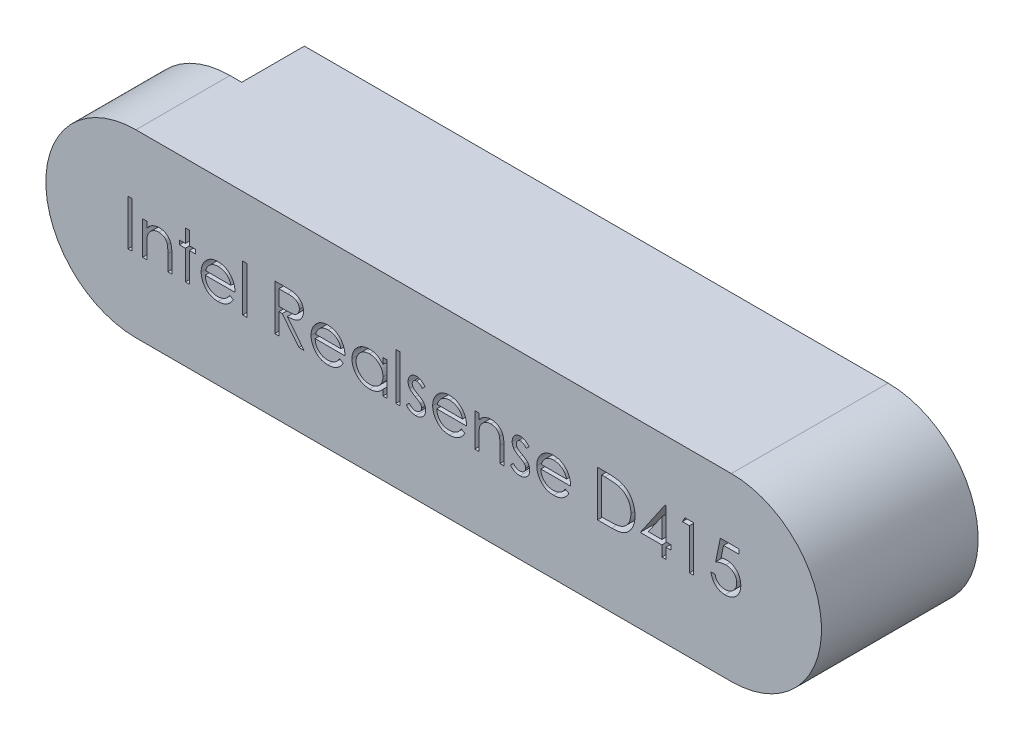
from build123d import *

# Parameters (mm, degrees)
BOSS_EXTRUDE1_DEPTH = 10
SKETCH3_W           = 0.522382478
SKETCH3_H           = 5.820833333
SKETCH3_W_2         = 0.522382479
SKETCH3_H_2         = 5.97008547
CUT_EXTRUDE1_DEPTH  = 5
SKETCH5_R           = 2.5
CUT_EXTRUDE2_DEPTH  = 10
SKETCH6_W           = 8
SKETCH6_H           = 23
CUT_EXTRUDE3_DEPTH  = 13
CUT_EXTRUDE4_DEPTH  = 5


with BuildPart() as part:
    # Sketch1 → Boss-Extrude1 (new, symmetric)
    with BuildSketch(Plane.XY):
        with BuildLine():
            Line((38, -11.5), (-38, -11.5))
            ThreePointArc((-38, -11.5), (-49.5, 0), (-38, 11.5))
            Line((-38, 11.5), (38, 11.5))
            ThreePointArc((38, 11.5), (49.5, 0), (38, -11.5))
        make_face()
    extrude(amount=BOSS_EXTRUDE1_DEPTH, both=True)

    # Sketch3 → Cut-Extrude1 (cut)
    # profile 1 of 18: a face of its own
    with BuildSketch(Plane.XY.offset(10)):
        with Locations((-38.743653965, 0.744491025)):
            Rectangle(SKETCH3_W, SKETCH3_H)
    # profile 2 of 18: a face of its own
    with BuildSketch(Plane.XY.offset(10)):
        with BuildLine():
            Line((-37.139193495, 2.087760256), (-36.616811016, 2.087760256))
            Line((-36.616811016, 2.087760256), (-36.616811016, 1.320510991))
            add(Edge.make_bspline(
                [(-36.616811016, 1.320510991), (-36.561034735, 1.390099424), (-36.452798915, 1.525138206), (-36.272545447, 1.702624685), (-36.082048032, 1.84888597), (-35.882473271, 1.965475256), (-35.673550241, 2.053364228), (-35.456552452, 2.116837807), (-35.230180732, 2.154897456), (-35.076237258, 2.159870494), (-34.998358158, 2.162386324)],
                knots=[0, 0, 0, 0, 1.12780773, 2.188550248, 3.19190651, 4.159438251, 5.104880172, 6.052711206, 7.014878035, 8, 8, 8, 8], degree=3))
            add(Edge.make_bspline(
                [(-34.998358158, 2.162386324), (-34.919642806, 2.159483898), (-34.765577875, 2.15380315), (-34.541262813, 2.10887182), (-34.331757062, 2.032127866), (-34.137807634, 1.927000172), (-33.962971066, 1.796270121), (-33.809426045, 1.643967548), (-33.682426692, 1.46878361), (-33.597280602, 1.306260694), (-33.541191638, 1.162088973), (-33.505880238, 1.038609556), (-33.475892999, 0.901041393), (-33.449895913, 0.749800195), (-33.432305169, 0.5838263), (-33.418431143, 0.403800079), (-33.408488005, 0.209779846), (-33.408093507, 0.0755903), (-33.407890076, 0.006392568)],
                knots=[0, 0, 0, 0, 1.235846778, 2.418850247, 3.575807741, 4.728682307, 5.871620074, 6.994088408, 8.11269785, 9.256955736, 9.865816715, 10.540099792, 11.271859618, 12.076849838, 12.949306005, 13.892391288, 14.913166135, 16, 16, 16, 16], degree=3))
            Line((-33.407890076, 0.006392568), (-33.407890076, -2.165925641))
            Line((-33.407890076, -2.165925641), (-33.930272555, -2.165925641))
            Line((-33.930272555, -2.165925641), (-33.930272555, -0.165014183))
            add(Edge.make_bspline(
                [(-33.930272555, -0.165014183), (-33.930593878, -0.107101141), (-33.931208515, 0.003676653), (-33.933147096, 0.162284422), (-33.937820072, 0.306119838), (-33.944386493, 0.434839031), (-33.953997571, 0.5483184), (-33.964013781, 0.646789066), (-33.976262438, 0.730126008), (-33.987177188, 0.780293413), (-33.992072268, 0.802792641)],
                knots=[0, 0, 0, 0, 1.430800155, 2.736877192, 3.918605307, 4.986035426, 5.920637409, 6.731861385, 7.431261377, 8, 8, 8, 8], degree=3))
            add(Edge.make_bspline(
                [(-33.992072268, 0.802792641), (-34.009743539, 0.868836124), (-34.043755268, 0.995949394), (-34.127798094, 1.168369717), (-34.233927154, 1.315051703), (-34.363478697, 1.435088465), (-34.515201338, 1.528505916), (-34.68867405, 1.593323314), (-34.882222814, 1.633863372), (-35.018354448, 1.637899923), (-35.089308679, 1.640003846)],
                knots=[0, 0, 0, 0, 1.084156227, 2.086665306, 3.027808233, 3.945421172, 4.874247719, 5.839848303, 6.874090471, 8, 8, 8, 8], degree=3))
            add(Edge.make_bspline(
                [(-35.089308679, 1.640003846), (-35.131331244, 1.639212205), (-35.214492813, 1.637645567), (-35.337811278, 1.621927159), (-35.457428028, 1.596218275), (-35.574543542, 1.561511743), (-35.686815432, 1.51384366), (-35.797850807, 1.459744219), (-35.903468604, 1.392308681), (-36.00592092, 1.317152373), (-36.101237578, 1.233865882), (-36.189927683, 1.145980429), (-36.268987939, 1.052388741), (-36.340615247, 0.954598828), (-36.40244624, 0.851267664), (-36.456418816, 0.743392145), (-36.502213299, 0.630830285), (-36.52496892, 0.552706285), (-36.536354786, 0.513616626)],
                knots=[0, 0, 0, 0, 1.023777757, 2.026029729, 3.023749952, 4.003683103, 4.997618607, 5.993177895, 7.010360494, 8.046726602, 9.087585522, 10.09234134, 11.086953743, 12.070360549, 13.043493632, 14.017870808, 15.008233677, 16, 16, 16, 16], degree=3))
            add(Edge.make_bspline(
                [(-36.536354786, 0.513616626), (-36.542906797, 0.48491958), (-36.557170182, 0.422447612), (-36.572575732, 0.319927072), (-36.586558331, 0.201331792), (-36.598261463, 0.066800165), (-36.605421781, -0.084138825), (-36.61322901, -0.25084057), (-36.616071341, -0.433969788), (-36.616557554, -0.561465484), (-36.616811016, -0.627929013)],
                knots=[0, 0, 0, 0, 0.615963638, 1.340920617, 2.168419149, 3.115676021, 4.16674242, 5.331190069, 6.6087489, 8, 8, 8, 8], degree=3))
            Line((-36.616811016, -0.627929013), (-36.616811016, -2.165925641))
            Line((-36.616811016, -2.165925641), (-37.139193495, -2.165925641))
            Line((-37.139193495, -2.165925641), (-37.139193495, 2.087760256))
        make_face()
    # profile 3 of 18: a face of its own
    with BuildSketch(Plane.XY.offset(10)):
        Polygon((-31.691490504, 3.804159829), (-31.169108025, 3.804159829), (-31.169108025, 2.087760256), (-30.422847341, 2.087760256), (-30.422847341, 1.565377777), (-31.169108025, 1.565377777), (-31.169108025, -2.165925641), (-31.691490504, -2.165925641), (-31.691490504, 1.565377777), (-32.437751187, 1.565377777), (-32.437751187, 2.087760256), (-31.691490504, 2.087760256), align=None)
    # profile 4 of 18: a face of its own
    with BuildSketch(Plane.XY.offset(10)):
        with BuildLine():
            Line((-26.036233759, -0.822656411), (-25.572152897, -1.066357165))
            add(Edge.make_bspline(
                [(-25.572152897, -1.066357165), (-25.609134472, -1.131955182), (-25.681085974, -1.259582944), (-25.804821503, -1.434926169), (-25.934529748, -1.592666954), (-26.076065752, -1.728591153), (-26.225194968, -1.847088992), (-26.382744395, -1.950762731), (-26.54953425, -2.039103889), (-26.725572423, -2.113531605), (-26.912337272, -2.170757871), (-27.110281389, -2.211178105), (-27.319783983, -2.236163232), (-27.463385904, -2.239065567), (-27.536917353, -2.24055171)],
                knots=[0, 0, 0, 0, 1.120438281, 2.179929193, 3.190490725, 4.156257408, 5.095198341, 6.022838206, 6.959905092, 7.901321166, 8.864066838, 9.862729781, 10.905609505, 12, 12, 12, 12], degree=3))
            add(Edge.make_bspline(
                [(-27.536917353, -2.24055171), (-27.618645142, -2.238643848), (-27.778072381, -2.234922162), (-28.01014027, -2.202836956), (-28.228636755, -2.150495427), (-28.433549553, -2.077376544), (-28.624376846, -1.981869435), (-28.801497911, -1.865520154), (-28.965844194, -1.728926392), (-29.112236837, -1.570904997), (-29.244026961, -1.401798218), (-29.360320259, -1.225583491), (-29.457540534, -1.042704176), (-29.536625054, -0.854324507), (-29.600496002, -0.661631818), (-29.64501158, -0.462872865), (-29.67067272, -0.25858559), (-29.674605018, -0.120386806), (-29.676586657, -0.050743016)],
                knots=[0, 0, 0, 0, 1.145258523, 2.234067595, 3.276747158, 4.290159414, 5.277019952, 6.260822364, 7.254936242, 8.264827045, 9.274100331, 10.257902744, 11.220704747, 12.172965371, 13.118907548, 14.062713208, 15.023725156, 16, 16, 16, 16], degree=3))
            add(Edge.make_bspline(
                [(-29.676586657, -0.050743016), (-29.674825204, 0.01460803), (-29.671334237, 0.144125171), (-29.649330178, 0.33582275), (-29.610333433, 0.522136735), (-29.556821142, 0.703221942), (-29.487717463, 0.878775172), (-29.403178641, 1.048903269), (-29.303072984, 1.213425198), (-29.225784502, 1.317207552), (-29.186853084, 1.369484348)],
                knots=[0, 0, 0, 0, 1.024358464, 2.0301432, 3.019427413, 4.004406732, 4.986367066, 5.972626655, 6.978780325, 8, 8, 8, 8], degree=3))
            add(Edge.make_bspline(
                [(-29.186853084, 1.369484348), (-29.134120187, 1.432463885), (-29.030324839, 1.556427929), (-28.854774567, 1.719308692), (-28.664682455, 1.855755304), (-28.462430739, 1.968857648), (-28.24566877, 2.054795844), (-28.017310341, 2.118837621), (-27.774755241, 2.154723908), (-27.608935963, 2.159792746), (-27.524090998, 2.162386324)],
                knots=[0, 0, 0, 0, 1.030682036, 2.02871468, 2.997146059, 3.962720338, 4.930598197, 5.918074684, 6.934738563, 8, 8, 8, 8], degree=3))
            add(Edge.make_bspline(
                [(-27.524090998, 2.162386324), (-27.436865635, 2.160134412), (-27.265749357, 2.155716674), (-27.016231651, 2.114760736), (-26.780137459, 2.049812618), (-26.557561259, 1.958086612), (-26.348480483, 1.8397415), (-26.15425416, 1.693153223), (-25.971560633, 1.52282219), (-25.86527458, 1.391831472), (-25.811189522, 1.32517512)],
                knots=[0, 0, 0, 0, 1.056321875, 2.072262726, 3.055038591, 4.01806755, 4.982017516, 5.957941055, 6.960871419, 8, 8, 8, 8], degree=3))
            add(Edge.make_bspline(
                [(-25.811189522, 1.32517512), (-25.774390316, 1.274943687), (-25.701036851, 1.174815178), (-25.609155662, 1.011547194), (-25.529397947, 0.840729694), (-25.465646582, 0.659601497), (-25.414024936, 0.470308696), (-25.376677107, 0.271498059), (-25.354774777, 0.06322879), (-25.350469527, -0.078677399), (-25.348274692, -0.151021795)],
                knots=[0, 0, 0, 0, 0.94817472, 1.890038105, 2.849395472, 3.817997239, 4.812318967, 5.836947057, 6.897266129, 8, 8, 8, 8], degree=3))
            Line((-25.348274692, -0.151021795), (-29.154204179, -0.151021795))
            add(Edge.make_bspline(
                [(-29.154204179, -0.151021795), (-29.151643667, -0.207068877), (-29.146608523, -0.317283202), (-29.123133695, -0.47855485), (-29.086131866, -0.632180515), (-29.034128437, -0.777007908), (-28.971152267, -0.914928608), (-28.894008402, -1.044919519), (-28.801973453, -1.166388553), (-28.699317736, -1.280422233), (-28.585051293, -1.381972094), (-28.464838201, -1.472863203), (-28.336956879, -1.549042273), (-28.202415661, -1.61087597), (-28.061432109, -1.659282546), (-27.913961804, -1.692324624), (-27.760294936, -1.71445561), (-27.655543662, -1.716916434), (-27.602215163, -1.718169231)],
                knots=[0, 0, 0, 0, 1.094153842, 2.151609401, 3.174256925, 4.172055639, 5.149267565, 6.128595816, 7.11444997, 8.118368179, 9.117203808, 10.09244225, 11.054858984, 12.015122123, 12.976791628, 13.957293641, 14.960065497, 16, 16, 16, 16], degree=3))
            add(Edge.make_bspline(
                [(-27.602215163, -1.718169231), (-27.550075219, -1.717157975), (-27.446619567, -1.715151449), (-27.292548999, -1.695640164), (-27.140975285, -1.664090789), (-26.992525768, -1.621033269), (-26.850213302, -1.568517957), (-26.718420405, -1.505149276), (-26.597213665, -1.435050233), (-26.483928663, -1.354872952), (-26.374046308, -1.256736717), (-26.265042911, -1.1342735), (-26.148166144, -0.989438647), (-26.075007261, -0.880429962), (-26.036233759, -0.822656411)],
                knots=[0, 0, 0, 0, 0.99110716, 1.966546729, 2.947904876, 3.932708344, 4.903319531, 5.828989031, 6.710028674, 7.56322171, 8.463672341, 9.504779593, 10.677557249, 12, 12, 12, 12], degree=3))
        make_face()
        with BuildLine():
            add(Edge.make_bspline(
                [(-25.87065717, 0.371360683), (-25.889777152, 0.44065001), (-25.926576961, 0.57400966), (-26.003472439, 0.758681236), (-26.09007237, 0.922808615), (-26.192555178, 1.065135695), (-26.308670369, 1.191536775), (-26.442790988, 1.301997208), (-26.593194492, 1.400814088), (-26.759103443, 1.484222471), (-26.934795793, 1.555219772), (-27.118744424, 1.602826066), (-27.306437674, 1.635438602), (-27.433388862, 1.638475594), (-27.497272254, 1.640003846)],
                knots=[0, 0, 0, 0, 1.154881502, 2.222775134, 3.210006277, 4.132804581, 5.035138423, 5.962687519, 6.919655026, 7.923214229, 8.944639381, 9.960483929, 10.97369054, 12, 12, 12, 12], degree=3))
            add(Edge.make_bspline(
                [(-27.497272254, 1.640003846), (-27.549409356, 1.638986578), (-27.652473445, 1.636975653), (-27.804315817, 1.617899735), (-27.950135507, 1.586367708), (-28.091008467, 1.543185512), (-28.22508865, 1.48562811), (-28.355133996, 1.418134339), (-28.477837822, 1.335741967), (-28.554575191, 1.272945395), (-28.593342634, 1.241220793)],
                knots=[0, 0, 0, 0, 1.04873581, 2.073130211, 3.073294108, 4.04793562, 5.032784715, 6.005352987, 6.992311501, 8, 8, 8, 8], degree=3))
            add(Edge.make_bspline(
                [(-28.593342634, 1.241220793), (-28.621105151, 1.216117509), (-28.677289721, 1.165314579), (-28.752362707, 1.077787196), (-28.82424247, 0.983403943), (-28.88965808, 0.878553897), (-28.949658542, 0.764431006), (-29.0058046, 0.641997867), (-29.056340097, 0.510325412), (-29.084772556, 0.418568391), (-29.09940066, 0.371360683)],
                knots=[0, 0, 0, 0, 0.879870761, 1.780643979, 2.707998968, 3.669668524, 4.684282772, 5.740141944, 6.837334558, 8, 8, 8, 8], degree=3))
            Line((-29.09940066, 0.371360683), (-25.87065717, 0.371360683))
        make_face(mode=Mode.SUBTRACT)
    # profile 5 of 18: a face of its own
    with BuildSketch(Plane.XY.offset(10)):
        with Locations((-24.116944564, 0.819117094)):
            Rectangle(SKETCH3_W_2, SKETCH3_H_2)
    # profile 6 of 18: a face of its own
    with BuildSketch(Plane.XY.offset(10)):
        with BuildLine():
            Line((-20.273702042, 3.654907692), (-19.108835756, 3.654907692))
            add(Edge.make_bspline(
                [(-19.108835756, 3.654907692), (-19.031100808, 3.654648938), (-18.881841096, 3.654152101), (-18.668011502, 3.651381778), (-18.473716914, 3.64344157), (-18.299058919, 3.636608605), (-18.144040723, 3.624148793), (-18.008186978, 3.612239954), (-17.892123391, 3.596650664), (-17.821864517, 3.582172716), (-17.790053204, 3.575617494)],
                knots=[0, 0, 0, 0, 1.410062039, 2.707475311, 3.878576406, 4.937260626, 5.877586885, 6.699081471, 7.410979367, 8, 8, 8, 8], degree=3))
            add(Edge.make_bspline(
                [(-17.790053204, 3.575617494), (-17.747466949, 3.565095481), (-17.66320292, 3.544275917), (-17.541880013, 3.500271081), (-17.426271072, 3.449347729), (-17.316856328, 3.389536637), (-17.214183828, 3.320393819), (-17.117194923, 3.243112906), (-17.025449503, 3.158116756), (-16.942657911, 3.063262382), (-16.864593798, 2.963748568), (-16.798754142, 2.856140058), (-16.741998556, 2.743612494), (-16.696811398, 2.625021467), (-16.660426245, 2.501517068), (-16.63477094, 2.371980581), (-16.619385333, 2.23700215), (-16.617818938, 2.144936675), (-16.617024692, 2.098254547)],
                knots=[0, 0, 0, 0, 1.027469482, 2.033020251, 3.019912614, 3.986113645, 4.951240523, 5.91722682, 6.890402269, 7.87763091, 8.8651537, 9.85103654, 10.82876324, 11.815024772, 12.821070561, 13.842952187, 14.906261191, 16, 16, 16, 16], degree=3))
            add(Edge.make_bspline(
                [(-16.617024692, 2.098254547), (-16.619467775, 2.020695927), (-16.624234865, 1.86935897), (-16.668681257, 1.649729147), (-16.741485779, 1.444853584), (-16.841809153, 1.254990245), (-16.969567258, 1.083840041), (-17.123112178, 0.933512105), (-17.302529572, 0.807715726), (-17.46955309, 0.720481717), (-17.617093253, 0.66461351), (-17.738554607, 0.625303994), (-17.871048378, 0.594932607), (-18.013305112, 0.56772415), (-18.165916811, 0.547182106), (-18.328517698, 0.532136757), (-18.501223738, 0.522733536), (-18.619867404, 0.521333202), (-18.680901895, 0.52061282)],
                knots=[0, 0, 0, 0, 1.260483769, 2.459530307, 3.627416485, 4.787058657, 5.939039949, 7.08810263, 8.267026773, 9.491475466, 10.141966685, 10.831826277, 11.566392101, 12.351337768, 13.187381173, 14.07005841, 15.007169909, 16, 16, 16, 16], degree=3))
            Line((-18.680901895, 0.52061282), (-16.542398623, -2.165925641))
            Line((-16.542398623, -2.165925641), (-17.188380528, -2.165925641))
            Line((-17.188380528, -2.165925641), (-19.326883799, 0.52061282))
            Line((-19.326883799, 0.52061282), (-19.751319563, 0.52061282))
            Line((-19.751319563, 0.52061282), (-19.751319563, -2.165925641))
            Line((-19.751319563, -2.165925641), (-20.273702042, -2.165925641))
            Line((-20.273702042, -2.165925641), (-20.273702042, 3.654907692))
        make_face()
        with BuildLine():
            Line((-19.751319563, 3.057899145), (-19.751319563, 1.117621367))
            Line((-19.751319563, 1.117621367), (-18.685566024, 1.109459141))
            add(Edge.make_bspline(
                [(-18.685566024, 1.109459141), (-18.63580615, 1.109437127), (-18.539357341, 1.109394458), (-18.399822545, 1.116036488), (-18.26990136, 1.123592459), (-18.150090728, 1.135149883), (-18.040337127, 1.150044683), (-17.940695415, 1.168676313), (-17.851002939, 1.190383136), (-17.746396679, 1.223980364), (-17.629586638, 1.27720942), (-17.502640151, 1.354652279), (-17.394535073, 1.452058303), (-17.303201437, 1.563441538), (-17.22980999, 1.685905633), (-17.178067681, 1.817982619), (-17.145234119, 1.956338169), (-17.141361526, 2.051430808), (-17.13940717, 2.099420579)],
                knots=[0, 0, 0, 0, 1.146690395, 2.22261258, 3.21895312, 4.145990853, 4.996080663, 5.770904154, 6.481378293, 7.121626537, 8.300444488, 9.431385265, 10.535395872, 11.636531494, 12.74115979, 13.810798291, 14.895190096, 16, 16, 16, 16], degree=3))
            add(Edge.make_bspline(
                [(-17.13940717, 2.099420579), (-17.141406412, 2.146231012), (-17.14536818, 2.238992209), (-17.177713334, 2.374793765), (-17.232411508, 2.502963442), (-17.306123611, 2.622979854), (-17.395929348, 2.731922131), (-17.501232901, 2.825133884), (-17.619154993, 2.902051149), (-17.729370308, 2.951202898), (-17.827882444, 2.98133794), (-17.913414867, 3.00254434), (-18.010059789, 3.019581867), (-18.118286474, 3.033232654), (-18.237632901, 3.044965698), (-18.368702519, 3.052868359), (-18.510625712, 3.057548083), (-18.608992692, 3.057779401), (-18.659913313, 3.057899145)],
                knots=[0, 0, 0, 0, 1.101028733, 2.181837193, 3.264309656, 4.369019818, 5.486613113, 6.575447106, 7.666700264, 8.788928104, 9.402425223, 10.0903467, 10.862060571, 11.710948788, 12.657782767, 13.684531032, 14.801375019, 16, 16, 16, 16], degree=3))
            Line((-18.659913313, 3.057899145), (-19.751319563, 3.057899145))
        make_face(mode=Mode.SUBTRACT)
    # profile 7 of 18: a face of its own
    with BuildSketch(Plane.XY.offset(10)):
        with BuildLine():
            Line((-12.006532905, -0.822656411), (-11.542452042, -1.066357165))
            add(Edge.make_bspline(
                [(-11.542452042, -1.066357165), (-11.579433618, -1.131955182), (-11.651385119, -1.259582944), (-11.775120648, -1.434926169), (-11.904828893, -1.592666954), (-12.046364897, -1.728591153), (-12.195494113, -1.847088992), (-12.35304354, -1.950762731), (-12.519833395, -2.039103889), (-12.695871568, -2.113531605), (-12.882636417, -2.170757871), (-13.080580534, -2.211178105), (-13.290083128, -2.236163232), (-13.433685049, -2.239065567), (-13.507216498, -2.24055171)],
                knots=[0, 0, 0, 0, 1.120438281, 2.179929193, 3.190490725, 4.156257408, 5.095198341, 6.022838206, 6.959905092, 7.901321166, 8.864066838, 9.862729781, 10.905609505, 12, 12, 12, 12], degree=3))
            add(Edge.make_bspline(
                [(-13.507216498, -2.24055171), (-13.588944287, -2.238643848), (-13.748371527, -2.234922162), (-13.980439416, -2.202836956), (-14.198935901, -2.150495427), (-14.403848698, -2.077376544), (-14.594675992, -1.981869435), (-14.771797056, -1.865520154), (-14.936143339, -1.728926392), (-15.082535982, -1.570904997), (-15.214326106, -1.401798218), (-15.330619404, -1.225583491), (-15.42783968, -1.042704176), (-15.506924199, -0.854324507), (-15.570795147, -0.661631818), (-15.615310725, -0.462872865), (-15.640971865, -0.25858559), (-15.644904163, -0.120386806), (-15.646885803, -0.050743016)],
                knots=[0, 0, 0, 0, 1.145258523, 2.234067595, 3.276747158, 4.290159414, 5.277019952, 6.260822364, 7.254936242, 8.264827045, 9.274100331, 10.257902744, 11.220704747, 12.172965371, 13.118907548, 14.062713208, 15.023725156, 16, 16, 16, 16], degree=3))
            add(Edge.make_bspline(
                [(-15.646885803, -0.050743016), (-15.64512435, 0.01460803), (-15.641633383, 0.144125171), (-15.619629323, 0.33582275), (-15.580632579, 0.522136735), (-15.527120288, 0.703221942), (-15.458016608, 0.878775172), (-15.373477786, 1.048903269), (-15.273372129, 1.213425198), (-15.196083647, 1.317207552), (-15.157152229, 1.369484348)],
                knots=[0, 0, 0, 0, 1.024358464, 2.0301432, 3.019427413, 4.004406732, 4.986367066, 5.972626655, 6.978780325, 8, 8, 8, 8], degree=3))
            add(Edge.make_bspline(
                [(-15.157152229, 1.369484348), (-15.104419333, 1.432463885), (-15.000623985, 1.556427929), (-14.825073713, 1.719308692), (-14.6349816, 1.855755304), (-14.432729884, 1.968857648), (-14.215967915, 2.054795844), (-13.987609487, 2.118837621), (-13.745054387, 2.154723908), (-13.579235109, 2.159792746), (-13.494390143, 2.162386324)],
                knots=[0, 0, 0, 0, 1.030682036, 2.02871468, 2.997146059, 3.962720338, 4.930598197, 5.918074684, 6.934738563, 8, 8, 8, 8], degree=3))
            add(Edge.make_bspline(
                [(-13.494390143, 2.162386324), (-13.40716478, 2.160134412), (-13.236048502, 2.155716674), (-12.986530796, 2.114760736), (-12.750436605, 2.049812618), (-12.527860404, 1.958086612), (-12.318779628, 1.8397415), (-12.124553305, 1.693153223), (-11.941859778, 1.52282219), (-11.835573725, 1.391831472), (-11.781488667, 1.32517512)],
                knots=[0, 0, 0, 0, 1.056321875, 2.072262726, 3.055038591, 4.01806755, 4.982017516, 5.957941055, 6.960871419, 8, 8, 8, 8], degree=3))
            add(Edge.make_bspline(
                [(-11.781488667, 1.32517512), (-11.744689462, 1.274943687), (-11.671335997, 1.174815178), (-11.579454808, 1.011547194), (-11.499697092, 0.840729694), (-11.435945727, 0.659601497), (-11.384324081, 0.470308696), (-11.346976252, 0.271498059), (-11.325073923, 0.06322879), (-11.320768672, -0.078677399), (-11.318573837, -0.151021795)],
                knots=[0, 0, 0, 0, 0.94817472, 1.890038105, 2.849395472, 3.817997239, 4.812318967, 5.836947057, 6.897266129, 8, 8, 8, 8], degree=3))
            Line((-11.318573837, -0.151021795), (-15.124503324, -0.151021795))
            add(Edge.make_bspline(
                [(-15.124503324, -0.151021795), (-15.121942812, -0.207068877), (-15.116907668, -0.317283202), (-15.093432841, -0.47855485), (-15.056431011, -0.632180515), (-15.004427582, -0.777007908), (-14.941451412, -0.914928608), (-14.864307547, -1.044919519), (-14.772272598, -1.166388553), (-14.669616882, -1.280422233), (-14.555350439, -1.381972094), (-14.435137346, -1.472863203), (-14.307256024, -1.549042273), (-14.172714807, -1.61087597), (-14.031731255, -1.659282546), (-13.884260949, -1.692324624), (-13.730594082, -1.71445561), (-13.625842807, -1.716916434), (-13.572514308, -1.718169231)],
                knots=[0, 0, 0, 0, 1.094153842, 2.151609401, 3.174256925, 4.172055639, 5.149267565, 6.128595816, 7.11444997, 8.118368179, 9.117203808, 10.09244225, 11.054858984, 12.015122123, 12.976791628, 13.957293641, 14.960065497, 16, 16, 16, 16], degree=3))
            add(Edge.make_bspline(
                [(-13.572514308, -1.718169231), (-13.520374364, -1.717157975), (-13.416918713, -1.715151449), (-13.262848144, -1.695640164), (-13.11127443, -1.664090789), (-12.962824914, -1.621033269), (-12.820512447, -1.568517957), (-12.68871955, -1.505149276), (-12.567512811, -1.435050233), (-12.454227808, -1.354872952), (-12.344345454, -1.256736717), (-12.235342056, -1.1342735), (-12.118465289, -0.989438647), (-12.045306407, -0.880429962), (-12.006532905, -0.822656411)],
                knots=[0, 0, 0, 0, 0.99110716, 1.966546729, 2.947904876, 3.932708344, 4.903319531, 5.828989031, 6.710028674, 7.56322171, 8.463672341, 9.504779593, 10.677557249, 12, 12, 12, 12], degree=3))
        make_face()
        with BuildLine():
            add(Edge.make_bspline(
                [(-11.840956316, 0.371360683), (-11.860076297, 0.44065001), (-11.896876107, 0.57400966), (-11.973771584, 0.758681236), (-12.060371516, 0.922808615), (-12.162854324, 1.065135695), (-12.278969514, 1.191536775), (-12.413090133, 1.301997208), (-12.563493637, 1.400814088), (-12.729402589, 1.484222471), (-12.905094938, 1.555219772), (-13.08904357, 1.602826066), (-13.276736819, 1.635438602), (-13.403688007, 1.638475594), (-13.4675714, 1.640003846)],
                knots=[0, 0, 0, 0, 1.154881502, 2.222775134, 3.210006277, 4.132804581, 5.035138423, 5.962687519, 6.919655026, 7.923214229, 8.944639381, 9.960483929, 10.97369054, 12, 12, 12, 12], degree=3))
            add(Edge.make_bspline(
                [(-13.4675714, 1.640003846), (-13.519708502, 1.638986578), (-13.622772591, 1.636975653), (-13.774614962, 1.617899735), (-13.920434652, 1.586367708), (-14.061307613, 1.543185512), (-14.195387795, 1.48562811), (-14.325433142, 1.418134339), (-14.448136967, 1.335741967), (-14.524874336, 1.272945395), (-14.563641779, 1.241220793)],
                knots=[0, 0, 0, 0, 1.04873581, 2.073130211, 3.073294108, 4.04793562, 5.032784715, 6.005352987, 6.992311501, 8, 8, 8, 8], degree=3))
            add(Edge.make_bspline(
                [(-14.563641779, 1.241220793), (-14.591404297, 1.216117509), (-14.647588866, 1.165314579), (-14.722661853, 1.077787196), (-14.794541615, 0.983403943), (-14.859957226, 0.878553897), (-14.919957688, 0.764431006), (-14.976103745, 0.641997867), (-15.026639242, 0.510325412), (-15.055071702, 0.418568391), (-15.069699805, 0.371360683)],
                knots=[0, 0, 0, 0, 0.879870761, 1.780643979, 2.707998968, 3.669668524, 4.684282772, 5.740141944, 6.837334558, 8, 8, 8, 8], degree=3))
            Line((-15.069699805, 0.371360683), (-11.840956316, 0.371360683))
        make_face(mode=Mode.SUBTRACT)
    # profile 8 of 18: a face of its own
    with BuildSketch(Plane.XY.offset(10)):
        with BuildLine():
            Line((-5.945496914, 2.087760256), (-5.945496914, -2.165925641))
            Line((-5.945496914, -2.165925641), (-6.467879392, -2.165925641))
            Line((-6.467879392, -2.165925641), (-6.467879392, -1.430159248))
            add(Edge.make_bspline(
                [(-6.467879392, -1.430159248), (-6.526784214, -1.496748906), (-6.641737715, -1.626699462), (-6.833727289, -1.796471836), (-7.037237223, -1.936801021), (-7.251279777, -2.050140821), (-7.475661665, -2.135278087), (-7.709885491, -2.195791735), (-7.9540468, -2.23469791), (-8.120776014, -2.238582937), (-8.205267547, -2.24055171)],
                knots=[0, 0, 0, 0, 1.074387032, 2.096679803, 3.090159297, 4.057316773, 5.018401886, 5.985159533, 6.978961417, 8, 8, 8, 8], degree=3))
            add(Edge.make_bspline(
                [(-8.205267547, -2.24055171), (-8.280386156, -2.238512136), (-8.428523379, -2.234490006), (-8.646437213, -2.203286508), (-8.856140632, -2.153176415), (-9.057831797, -2.083491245), (-9.250205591, -1.991055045), (-9.434909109, -1.880390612), (-9.610985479, -1.748605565), (-9.775750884, -1.597949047), (-9.927478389, -1.434308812), (-10.06062791, -1.259774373), (-10.171644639, -1.075100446), (-10.26447875, -0.882625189), (-10.335985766, -0.680866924), (-10.385834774, -0.470523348), (-10.417001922, -0.251843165), (-10.421022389, -0.102930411), (-10.423061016, -0.027422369)],
                knots=[0, 0, 0, 0, 1.033919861, 2.038935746, 3.024066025, 3.998881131, 4.97069526, 5.957263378, 6.95902576, 7.993208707, 9.027059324, 10.027763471, 11.009749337, 11.988697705, 12.965288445, 13.950418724, 14.960734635, 16, 16, 16, 16], degree=3))
            add(Edge.make_bspline(
                [(-10.423061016, -0.027422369), (-10.420977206, 0.046525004), (-10.416857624, 0.192714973), (-10.386168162, 0.40771776), (-10.334560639, 0.614803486), (-10.262136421, 0.81330545), (-10.169265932, 1.003463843), (-10.056295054, 1.185413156), (-9.923215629, 1.359654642), (-9.76979109, 1.522091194), (-9.603590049, 1.672136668), (-9.425790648, 1.802538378), (-9.240815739, 1.915157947), (-9.045796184, 2.004388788), (-8.843618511, 2.076582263), (-8.63248284, 2.12652995), (-8.413267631, 2.15596228), (-8.26443642, 2.160224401), (-8.188943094, 2.162386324)],
                knots=[0, 0, 0, 0, 1.020392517, 2.01726096, 2.990465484, 3.961182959, 4.928053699, 5.906110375, 6.912531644, 7.948652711, 8.985773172, 9.998621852, 10.987621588, 11.969261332, 12.953316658, 13.946091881, 14.958173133, 16, 16, 16, 16], degree=3))
            add(Edge.make_bspline(
                [(-8.188943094, 2.162386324), (-8.102129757, 2.159995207), (-7.931892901, 2.155306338), (-7.682880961, 2.116285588), (-7.447312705, 2.050363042), (-7.223369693, 1.960693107), (-7.0118561, 1.841534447), (-6.814774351, 1.691223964), (-6.630061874, 1.510709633), (-6.522991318, 1.372056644), (-6.467879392, 1.300688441)],
                knots=[0, 0, 0, 0, 1.038897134, 2.037228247, 3.008116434, 3.962042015, 4.918381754, 5.904844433, 6.921570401, 8, 8, 8, 8], degree=3))
            Line((-6.467879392, 1.300688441), (-6.467879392, 2.087760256))
            Line((-6.467879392, 2.087760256), (-5.945496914, 2.087760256))
        make_face()
        with BuildLine():
            add(Edge.make_bspline(
                [(-8.1819469, 1.640003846), (-8.258306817, 1.637286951), (-8.409029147, 1.631924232), (-8.630293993, 1.590058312), (-8.842028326, 1.520400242), (-9.043173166, 1.425134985), (-9.230551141, 1.305344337), (-9.398014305, 1.160453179), (-9.546932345, 0.994414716), (-9.672177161, 0.80797823), (-9.774275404, 0.608110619), (-9.846066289, 0.399185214), (-9.893413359, 0.184970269), (-9.898250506, 0.039677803), (-9.900678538, -0.033252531)],
                knots=[0, 0, 0, 0, 1.031046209, 2.035121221, 3.029706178, 4.034933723, 5.034054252, 6.02443088, 7.017295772, 8.038157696, 9.050218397, 10.03989886, 11.016116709, 12, 12, 12, 12], degree=3))
            add(Edge.make_bspline(
                [(-9.900678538, -0.033252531), (-9.897577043, -0.105747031), (-9.891386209, -0.250451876), (-9.846897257, -0.464958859), (-9.772257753, -0.673933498), (-9.67040637, -0.875602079), (-9.542869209, -1.06284016), (-9.395038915, -1.232043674), (-9.225485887, -1.377547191), (-9.037676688, -1.499348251), (-8.837094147, -1.597741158), (-8.626157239, -1.666203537), (-8.408831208, -1.710404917), (-8.261061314, -1.715567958), (-8.18661103, -1.718169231)],
                knots=[0, 0, 0, 0, 0.979072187, 1.954306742, 2.945804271, 3.96968567, 4.997920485, 5.998718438, 6.996577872, 8.005894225, 9.015743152, 10.005417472, 10.995077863, 12, 12, 12, 12], degree=3))
            add(Edge.make_bspline(
                [(-8.18661103, -1.718169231), (-8.111029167, -1.715408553), (-7.96070434, -1.709917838), (-7.73878306, -1.667872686), (-7.523420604, -1.598407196), (-7.317550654, -1.502115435), (-7.125768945, -1.382776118), (-6.953642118, -1.243064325), (-6.808094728, -1.080574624), (-6.684705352, -0.901997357), (-6.587954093, -0.706231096), (-6.517478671, -0.4977884), (-6.47581164, -0.276662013), (-6.470560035, -0.125546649), (-6.467879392, -0.048410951)],
                knots=[0, 0, 0, 0, 1.01762866, 2.023962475, 3.030623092, 4.058876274, 5.077231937, 6.066672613, 7.034107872, 8.005628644, 8.981990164, 9.965428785, 10.961468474, 12, 12, 12, 12], degree=3))
            add(Edge.make_bspline(
                [(-6.467879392, -0.048410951), (-6.469475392, 0.010359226), (-6.472616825, 0.126037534), (-6.496616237, 0.295885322), (-6.534792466, 0.458425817), (-6.588587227, 0.613829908), (-6.65925428, 0.76123838), (-6.744484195, 0.901709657), (-6.845775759, 1.034513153), (-6.961498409, 1.157820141), (-7.088168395, 1.270289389), (-7.222204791, 1.37068087), (-7.365195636, 1.453151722), (-7.514736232, 1.521407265), (-7.671086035, 1.575722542), (-7.835517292, 1.611957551), (-8.006282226, 1.63683799), (-8.122775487, 1.63893745), (-8.1819469, 1.640003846)],
                knots=[0, 0, 0, 0, 1.050140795, 2.067009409, 3.05949893, 4.030605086, 5.00011959, 5.97591094, 6.962425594, 7.979863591, 8.993523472, 9.986985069, 10.967611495, 11.937549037, 12.921786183, 13.919465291, 14.943216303, 16, 16, 16, 16], degree=3))
        make_face(mode=Mode.SUBTRACT)
    # profile 9 of 18: a face of its own
    with BuildSketch(Plane.XY.offset(10)):
        with Locations((-4.564914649, 0.819117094)):
            Rectangle(SKETCH3_W, SKETCH3_H_2)
    # profile 10 of 18: a face of its own
    with BuildSketch(Plane.XY.offset(10)):
        with BuildLine():
            Line((-1.094802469, 1.557215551), (-1.449276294, 1.192247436))
            add(Edge.make_bspline(
                [(-1.449276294, 1.192247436), (-1.479861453, 1.227693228), (-1.538826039, 1.296028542), (-1.632344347, 1.387394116), (-1.725516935, 1.464124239), (-1.817068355, 1.528905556), (-1.909300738, 1.577882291), (-2.001131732, 1.613630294), (-2.092656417, 1.635752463), (-2.153835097, 1.638603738), (-2.183876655, 1.640003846)],
                knots=[0, 0, 0, 0, 1.26578478, 2.440284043, 3.530471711, 4.527705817, 5.468200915, 6.346673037, 7.188140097, 8, 8, 8, 8], degree=3))
            add(Edge.make_bspline(
                [(-2.183876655, 1.640003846), (-2.220696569, 1.63821623), (-2.293152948, 1.634698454), (-2.396973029, 1.599584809), (-2.493350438, 1.54568599), (-2.576766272, 1.469235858), (-2.647427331, 1.381483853), (-2.699006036, 1.283367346), (-2.730548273, 1.177847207), (-2.734547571, 1.10462136), (-2.736575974, 1.067481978)],
                knots=[0, 0, 0, 0, 0.99966794, 1.967205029, 2.953328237, 3.988086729, 5.028030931, 6.008226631, 6.989793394, 8, 8, 8, 8], degree=3))
            add(Edge.make_bspline(
                [(-2.736575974, 1.067481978), (-2.734728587, 1.033867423), (-2.731039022, 0.966733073), (-2.702356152, 0.867699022), (-2.656677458, 0.771144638), (-2.61398548, 0.712000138), (-2.591987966, 0.68152528)],
                knots=[0, 0, 0, 0, 0.960159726, 1.917612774, 2.927026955, 4, 4, 4, 4], degree=3))
            add(Edge.make_bspline(
                [(-2.591987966, 0.68152528), (-2.578743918, 0.665252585), (-2.550555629, 0.630618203), (-2.49765504, 0.582548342), (-2.437746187, 0.529425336), (-2.365701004, 0.476311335), (-2.284623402, 0.420378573), (-2.192755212, 0.363829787), (-2.093011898, 0.302354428), (-2.021603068, 0.263364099), (-1.984485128, 0.243097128)],
                knots=[0, 0, 0, 0, 0.66740084, 1.420478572, 2.27185888, 3.217733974, 4.268547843, 5.408967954, 6.65319498, 8, 8, 8, 8], degree=3))
            add(Edge.make_bspline(
                [(-1.984485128, 0.243097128), (-1.939226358, 0.217743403), (-1.851801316, 0.168768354), (-1.72758013, 0.092748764), (-1.614843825, 0.017191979), (-1.512637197, -0.057093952), (-1.422926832, -0.132187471), (-1.342990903, -0.205210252), (-1.274823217, -0.278368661), (-1.236648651, -0.329480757), (-1.218401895, -0.353911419)],
                knots=[0, 0, 0, 0, 1.27191281, 2.456916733, 3.569705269, 4.599008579, 5.553216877, 6.436649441, 7.252746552, 8, 8, 8, 8], degree=3))
            add(Edge.make_bspline(
                [(-1.218401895, -0.353911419), (-1.188116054, -0.403248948), (-1.127841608, -0.501439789), (-1.064547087, -0.663123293), (-1.027858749, -0.834605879), (-1.022765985, -0.951907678), (-1.020176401, -1.011553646)],
                knots=[0, 0, 0, 0, 0.995354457, 1.980940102, 2.973342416, 4, 4, 4, 4], degree=3))
            add(Edge.make_bspline(
                [(-1.020176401, -1.011553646), (-1.021373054, -1.053578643), (-1.02373119, -1.13639349), (-1.040126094, -1.258356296), (-1.068323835, -1.374996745), (-1.106730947, -1.48758045), (-1.158593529, -1.593950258), (-1.219375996, -1.696789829), (-1.292344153, -1.793874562), (-1.375650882, -1.885076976), (-1.466864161, -1.968374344), (-1.564165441, -2.041590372), (-1.667674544, -2.102416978), (-1.776651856, -2.152751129), (-1.89134498, -2.192778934), (-2.011771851, -2.220490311), (-2.137549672, -2.237075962), (-2.223082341, -2.239378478), (-2.266664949, -2.24055171)],
                knots=[0, 0, 0, 0, 1.032770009, 2.035186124, 3.017557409, 3.978232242, 4.952395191, 5.920591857, 6.910227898, 7.931268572, 8.952309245, 9.941945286, 10.918353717, 11.897095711, 12.887975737, 13.898235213, 14.929059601, 16, 16, 16, 16], degree=3))
            add(Edge.make_bspline(
                [(-2.266664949, -2.24055171), (-2.32548393, -2.238900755), (-2.442304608, -2.235621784), (-2.615083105, -2.204844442), (-2.783921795, -2.156954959), (-2.947542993, -2.090903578), (-3.102287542, -2.007498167), (-3.243868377, -1.907608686), (-3.372777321, -1.794534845), (-3.446150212, -1.707866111), (-3.482836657, -1.664531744)],
                knots=[0, 0, 0, 0, 1.013940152, 2.01379169, 3.017749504, 4.037548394, 5.051665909, 6.043208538, 7.021604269, 8, 8, 8, 8], degree=3))
            Line((-3.482836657, -1.664531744), (-3.136525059, -1.270412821))
            add(Edge.make_bspline(
                [(-3.136525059, -1.270412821), (-3.103641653, -1.305927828), (-3.039892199, -1.374779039), (-2.937942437, -1.466456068), (-2.834199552, -1.543293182), (-2.729699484, -1.607560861), (-2.622895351, -1.657080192), (-2.514385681, -1.691869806), (-2.404391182, -1.714228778), (-2.33051294, -1.716853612), (-2.293483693, -1.718169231)],
                knots=[0, 0, 0, 0, 1.179806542, 2.287233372, 3.337373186, 4.324005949, 5.273901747, 6.200048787, 7.097828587, 8, 8, 8, 8], degree=3))
            add(Edge.make_bspline(
                [(-2.293483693, -1.718169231), (-2.243062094, -1.715889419), (-2.144546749, -1.711435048), (-2.003443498, -1.670993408), (-1.873158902, -1.607579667), (-1.7600296, -1.517631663), (-1.663732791, -1.41293055), (-1.594002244, -1.294993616), (-1.550302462, -1.16728211), (-1.545170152, -1.078751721), (-1.54255888, -1.03370826)],
                knots=[0, 0, 0, 0, 1.072336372, 2.095165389, 3.102688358, 4.141489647, 5.156069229, 6.117746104, 7.042326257, 8, 8, 8, 8], degree=3))
            add(Edge.make_bspline(
                [(-1.54255888, -1.03370826), (-1.544365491, -0.99660524), (-1.547932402, -0.923350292), (-1.575944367, -0.817327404), (-1.620204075, -0.716761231), (-1.663784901, -0.657904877), (-1.685980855, -0.627929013)],
                knots=[0, 0, 0, 0, 1.013901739, 2.00181326, 2.98231254, 4, 4, 4, 4], degree=3))
            add(Edge.make_bspline(
                [(-1.685980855, -0.627929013), (-1.699322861, -0.612902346), (-1.728386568, -0.580168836), (-1.781697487, -0.532895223), (-1.84553018, -0.481941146), (-1.92060257, -0.428170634), (-2.007065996, -0.372292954), (-2.105270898, -0.314601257), (-2.213871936, -0.252355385), (-2.290658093, -0.211077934), (-2.330796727, -0.189500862)],
                knots=[0, 0, 0, 0, 0.615000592, 1.339693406, 2.178160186, 3.116406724, 4.166410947, 5.330106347, 6.604359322, 8, 8, 8, 8], degree=3))
            add(Edge.make_bspline(
                [(-2.330796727, -0.189500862), (-2.37411477, -0.165320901), (-2.45812228, -0.118428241), (-2.577112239, -0.045391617), (-2.684460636, 0.028894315), (-2.78275052, 0.100262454), (-2.86949924, 0.172475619), (-2.944365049, 0.245613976), (-3.010295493, 0.316727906), (-3.046796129, 0.367115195), (-3.064231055, 0.391183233)],
                knots=[0, 0, 0, 0, 1.262093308, 2.447601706, 3.550203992, 4.582594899, 5.537233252, 6.418365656, 7.244515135, 8, 8, 8, 8], degree=3))
            add(Edge.make_bspline(
                [(-3.064231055, 0.391183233), (-3.094383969, 0.439655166), (-3.154700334, 0.536615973), (-3.213266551, 0.698452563), (-3.253523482, 0.86882845), (-3.257119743, 0.986387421), (-3.258958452, 1.046493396)],
                knots=[0, 0, 0, 0, 0.985009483, 1.970363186, 2.962279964, 4, 4, 4, 4], degree=3))
            add(Edge.make_bspline(
                [(-3.258958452, 1.046493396), (-3.258070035, 1.085784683), (-3.256331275, 1.162683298), (-3.242454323, 1.275672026), (-3.21718906, 1.383021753), (-3.185498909, 1.486344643), (-3.141455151, 1.583639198), (-3.088824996, 1.676202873), (-3.026978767, 1.763907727), (-2.955726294, 1.845404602), (-2.877383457, 1.919427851), (-2.792740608, 1.983953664), (-2.703701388, 2.039012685), (-2.609888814, 2.085188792), (-2.51040167, 2.120116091), (-2.405935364, 2.144160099), (-2.296701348, 2.160217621), (-2.222026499, 2.161653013), (-2.183876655, 2.162386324)],
                knots=[0, 0, 0, 0, 1.087655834, 2.128696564, 3.144119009, 4.137814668, 5.115653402, 6.093965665, 7.082169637, 8.081268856, 9.086088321, 10.061021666, 11.022561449, 11.980240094, 12.950172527, 13.934149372, 14.944599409, 16, 16, 16, 16], degree=3))
            add(Edge.make_bspline(
                [(-2.183876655, 2.162386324), (-2.138653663, 2.160549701), (-2.047359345, 2.156842), (-1.910395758, 2.12739575), (-1.773633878, 2.078944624), (-1.636722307, 2.012027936), (-1.500664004, 1.925435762), (-1.364262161, 1.820778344), (-1.225879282, 1.698744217), (-1.139470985, 1.605445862), (-1.094802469, 1.557215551)],
                knots=[0, 0, 0, 0, 0.845714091, 1.707292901, 2.609013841, 3.555613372, 4.552488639, 5.621697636, 6.770543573, 8, 8, 8, 8], degree=3))
        make_face()
    # profile 11 of 18: a face of its own
    with BuildSketch(Plane.XY.offset(10)):
        with BuildLine():
            Line((3.515689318, -0.822656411), (3.97977018, -1.066357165))
            add(Edge.make_bspline(
                [(3.97977018, -1.066357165), (3.942788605, -1.131955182), (3.870837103, -1.259582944), (3.747101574, -1.434926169), (3.617393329, -1.592666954), (3.475857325, -1.728591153), (3.326728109, -1.847088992), (3.169178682, -1.950762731), (3.002388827, -2.039103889), (2.826350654, -2.113531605), (2.639585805, -2.170757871), (2.441641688, -2.211178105), (2.232139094, -2.236163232), (2.088537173, -2.239065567), (2.015005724, -2.24055171)],
                knots=[0, 0, 0, 0, 1.120438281, 2.179929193, 3.190490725, 4.156257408, 5.095198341, 6.022838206, 6.959905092, 7.901321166, 8.864066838, 9.862729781, 10.905609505, 12, 12, 12, 12], degree=3))
            add(Edge.make_bspline(
                [(2.015005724, -2.24055171), (1.933277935, -2.238643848), (1.773850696, -2.234922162), (1.541782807, -2.202836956), (1.323286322, -2.150495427), (1.118373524, -2.077376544), (0.927546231, -1.981869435), (0.750425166, -1.865520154), (0.586078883, -1.728926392), (0.43968624, -1.570904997), (0.307896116, -1.401798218), (0.191602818, -1.225583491), (0.094382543, -1.042704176), (0.015298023, -0.854324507), (-0.048572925, -0.661631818), (-0.093088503, -0.462872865), (-0.118749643, -0.25858559), (-0.122681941, -0.120386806), (-0.12466358, -0.050743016)],
                knots=[0, 0, 0, 0, 1.145258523, 2.234067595, 3.276747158, 4.290159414, 5.277019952, 6.260822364, 7.254936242, 8.264827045, 9.274100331, 10.257902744, 11.220704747, 12.172965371, 13.118907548, 14.062713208, 15.023725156, 16, 16, 16, 16], degree=3))
            add(Edge.make_bspline(
                [(-0.12466358, -0.050743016), (-0.122902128, 0.01460803), (-0.119411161, 0.144125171), (-0.097407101, 0.33582275), (-0.058410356, 0.522136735), (-0.004898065, 0.703221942), (0.064205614, 0.878775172), (0.148744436, 1.048903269), (0.248850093, 1.213425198), (0.326138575, 1.317207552), (0.365069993, 1.369484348)],
                knots=[0, 0, 0, 0, 1.024358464, 2.0301432, 3.019427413, 4.004406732, 4.986367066, 5.972626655, 6.978780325, 8, 8, 8, 8], degree=3))
            add(Edge.make_bspline(
                [(0.365069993, 1.369484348), (0.417802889, 1.432463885), (0.521598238, 1.556427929), (0.69714851, 1.719308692), (0.887240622, 1.855755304), (1.089492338, 1.968857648), (1.306254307, 2.054795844), (1.534612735, 2.118837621), (1.777167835, 2.154723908), (1.942987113, 2.159792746), (2.027832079, 2.162386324)],
                knots=[0, 0, 0, 0, 1.030682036, 2.02871468, 2.997146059, 3.962720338, 4.930598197, 5.918074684, 6.934738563, 8, 8, 8, 8], degree=3))
            add(Edge.make_bspline(
                [(2.027832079, 2.162386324), (2.115057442, 2.160134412), (2.28617372, 2.155716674), (2.535691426, 2.114760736), (2.771785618, 2.049812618), (2.994361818, 1.958086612), (3.203442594, 1.8397415), (3.397668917, 1.693153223), (3.580362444, 1.52282219), (3.686648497, 1.391831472), (3.740733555, 1.32517512)],
                knots=[0, 0, 0, 0, 1.056321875, 2.072262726, 3.055038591, 4.01806755, 4.982017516, 5.957941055, 6.960871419, 8, 8, 8, 8], degree=3))
            add(Edge.make_bspline(
                [(3.740733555, 1.32517512), (3.777532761, 1.274943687), (3.850886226, 1.174815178), (3.942767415, 1.011547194), (4.02252513, 0.840729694), (4.086276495, 0.659601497), (4.137898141, 0.470308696), (4.17524597, 0.271498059), (4.1971483, 0.06322879), (4.20145355, -0.078677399), (4.203648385, -0.151021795)],
                knots=[0, 0, 0, 0, 0.94817472, 1.890038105, 2.849395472, 3.817997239, 4.812318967, 5.836947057, 6.897266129, 8, 8, 8, 8], degree=3))
            Line((4.203648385, -0.151021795), (0.397718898, -0.151021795))
            add(Edge.make_bspline(
                [(0.397718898, -0.151021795), (0.40027941, -0.207068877), (0.405314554, -0.317283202), (0.428789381, -0.47855485), (0.465791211, -0.632180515), (0.51779464, -0.777007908), (0.58077081, -0.914928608), (0.657914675, -1.044919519), (0.749949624, -1.166388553), (0.85260534, -1.280422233), (0.966871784, -1.381972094), (1.087084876, -1.472863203), (1.214966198, -1.549042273), (1.349507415, -1.61087597), (1.490490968, -1.659282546), (1.637961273, -1.692324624), (1.79162814, -1.71445561), (1.896379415, -1.716916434), (1.949707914, -1.718169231)],
                knots=[0, 0, 0, 0, 1.094153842, 2.151609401, 3.174256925, 4.172055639, 5.149267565, 6.128595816, 7.11444997, 8.118368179, 9.117203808, 10.09244225, 11.054858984, 12.015122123, 12.976791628, 13.957293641, 14.960065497, 16, 16, 16, 16], degree=3))
            add(Edge.make_bspline(
                [(1.949707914, -1.718169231), (2.001847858, -1.717157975), (2.10530351, -1.715151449), (2.259374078, -1.695640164), (2.410947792, -1.664090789), (2.559397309, -1.621033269), (2.701709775, -1.568517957), (2.833502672, -1.505149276), (2.954709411, -1.435050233), (3.067994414, -1.354872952), (3.177876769, -1.256736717), (3.286880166, -1.1342735), (3.403756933, -0.989438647), (3.476915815, -0.880429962), (3.515689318, -0.822656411)],
                knots=[0, 0, 0, 0, 0.99110716, 1.966546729, 2.947904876, 3.932708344, 4.903319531, 5.828989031, 6.710028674, 7.56322171, 8.463672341, 9.504779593, 10.677557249, 12, 12, 12, 12], degree=3))
        make_face()
        with BuildLine():
            add(Edge.make_bspline(
                [(3.681265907, 0.371360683), (3.662145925, 0.44065001), (3.625346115, 0.57400966), (3.548450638, 0.758681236), (3.461850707, 0.922808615), (3.359367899, 1.065135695), (3.243252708, 1.191536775), (3.109132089, 1.301997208), (2.958728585, 1.400814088), (2.792819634, 1.484222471), (2.617127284, 1.555219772), (2.433178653, 1.602826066), (2.245485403, 1.635438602), (2.118534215, 1.638475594), (2.054650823, 1.640003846)],
                knots=[0, 0, 0, 0, 1.154881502, 2.222775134, 3.210006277, 4.132804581, 5.035138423, 5.962687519, 6.919655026, 7.923214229, 8.944639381, 9.960483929, 10.97369054, 12, 12, 12, 12], degree=3))
            add(Edge.make_bspline(
                [(2.054650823, 1.640003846), (2.002513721, 1.638986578), (1.899449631, 1.636975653), (1.74760726, 1.617899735), (1.60178757, 1.586367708), (1.46091461, 1.543185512), (1.326834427, 1.48562811), (1.196789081, 1.418134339), (1.074085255, 1.335741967), (0.997347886, 1.272945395), (0.958580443, 1.241220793)],
                knots=[0, 0, 0, 0, 1.04873581, 2.073130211, 3.073294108, 4.04793562, 5.032784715, 6.005352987, 6.992311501, 8, 8, 8, 8], degree=3))
            add(Edge.make_bspline(
                [(0.958580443, 1.241220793), (0.930817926, 1.216117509), (0.874633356, 1.165314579), (0.79956037, 1.077787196), (0.727680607, 0.983403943), (0.662264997, 0.878553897), (0.602264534, 0.764431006), (0.546118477, 0.641997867), (0.49558298, 0.510325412), (0.467150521, 0.418568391), (0.452522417, 0.371360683)],
                knots=[0, 0, 0, 0, 0.879870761, 1.780643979, 2.707998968, 3.669668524, 4.684282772, 5.740141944, 6.837334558, 8, 8, 8, 8], degree=3))
            Line((0.452522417, 0.371360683), (3.681265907, 0.371360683))
        make_face(mode=Mode.SUBTRACT)
    # profile 12 of 18: a face of its own
    with BuildSketch(Plane.XY.offset(10)):
        with BuildLine():
            Line((5.248413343, 2.087760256), (5.770795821, 2.087760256))
            Line((5.770795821, 2.087760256), (5.770795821, 1.320510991))
            add(Edge.make_bspline(
                [(5.770795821, 1.320510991), (5.826572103, 1.390099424), (5.934807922, 1.525138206), (6.115061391, 1.702624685), (6.305558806, 1.84888597), (6.505133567, 1.965475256), (6.714056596, 2.053364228), (6.931054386, 2.116837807), (7.157426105, 2.154897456), (7.31136958, 2.159870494), (7.389248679, 2.162386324)],
                knots=[0, 0, 0, 0, 1.12780773, 2.188550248, 3.19190651, 4.159438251, 5.104880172, 6.052711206, 7.014878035, 8, 8, 8, 8], degree=3))
            add(Edge.make_bspline(
                [(7.389248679, 2.162386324), (7.467964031, 2.159483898), (7.622028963, 2.15380315), (7.846344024, 2.10887182), (8.055849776, 2.032127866), (8.249799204, 1.927000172), (8.424635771, 1.796270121), (8.578180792, 1.643967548), (8.705180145, 1.46878361), (8.790326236, 1.306260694), (8.8464152, 1.162088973), (8.8817266, 1.038609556), (8.911713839, 0.901041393), (8.937710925, 0.749800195), (8.955301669, 0.5838263), (8.969175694, 0.403800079), (8.979118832, 0.209779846), (8.97951333, 0.0755903), (8.979716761, 0.006392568)],
                knots=[0, 0, 0, 0, 1.235846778, 2.418850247, 3.575807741, 4.728682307, 5.871620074, 6.994088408, 8.11269785, 9.256955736, 9.865816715, 10.540099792, 11.271859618, 12.076849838, 12.949306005, 13.892391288, 14.913166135, 16, 16, 16, 16], degree=3))
            Line((8.979716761, 0.006392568), (8.979716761, -2.165925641))
            Line((8.979716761, -2.165925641), (8.457334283, -2.165925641))
            Line((8.457334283, -2.165925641), (8.457334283, -0.165014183))
            add(Edge.make_bspline(
                [(8.457334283, -0.165014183), (8.457012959, -0.107101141), (8.456398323, 0.003676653), (8.454459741, 0.162284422), (8.449786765, 0.306119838), (8.443220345, 0.434839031), (8.433609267, 0.5483184), (8.423593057, 0.646789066), (8.411344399, 0.730126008), (8.40042965, 0.780293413), (8.39553457, 0.802792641)],
                knots=[0, 0, 0, 0, 1.430800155, 2.736877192, 3.918605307, 4.986035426, 5.920637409, 6.731861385, 7.431261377, 8, 8, 8, 8], degree=3))
            add(Edge.make_bspline(
                [(8.39553457, 0.802792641), (8.377863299, 0.868836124), (8.34385157, 0.995949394), (8.259808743, 1.168369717), (8.153679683, 1.315051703), (8.024128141, 1.435088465), (7.8724055, 1.528505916), (7.698932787, 1.593323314), (7.505384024, 1.633863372), (7.36925239, 1.637899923), (7.298298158, 1.640003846)],
                knots=[0, 0, 0, 0, 1.084156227, 2.086665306, 3.027808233, 3.945421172, 4.874247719, 5.839848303, 6.874090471, 8, 8, 8, 8], degree=3))
            add(Edge.make_bspline(
                [(7.298298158, 1.640003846), (7.256275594, 1.639212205), (7.173114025, 1.637645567), (7.04979556, 1.621927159), (6.93017881, 1.596218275), (6.813063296, 1.561511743), (6.700791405, 1.51384366), (6.589756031, 1.459744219), (6.484138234, 1.392308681), (6.381685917, 1.317152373), (6.28636926, 1.233865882), (6.197679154, 1.145980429), (6.118618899, 1.052388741), (6.04699159, 0.954598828), (5.985160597, 0.851267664), (5.931188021, 0.743392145), (5.885393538, 0.630830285), (5.862637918, 0.552706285), (5.851252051, 0.513616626)],
                knots=[0, 0, 0, 0, 1.023777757, 2.026029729, 3.023749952, 4.003683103, 4.997618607, 5.993177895, 7.010360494, 8.046726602, 9.087585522, 10.09234134, 11.086953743, 12.070360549, 13.043493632, 14.017870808, 15.008233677, 16, 16, 16, 16], degree=3))
            add(Edge.make_bspline(
                [(5.851252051, 0.513616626), (5.84470004, 0.48491958), (5.830436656, 0.422447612), (5.815031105, 0.319927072), (5.801048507, 0.201331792), (5.789345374, 0.066800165), (5.782185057, -0.084138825), (5.774377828, -0.25084057), (5.771535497, -0.433969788), (5.771049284, -0.561465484), (5.770795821, -0.627929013)],
                knots=[0, 0, 0, 0, 0.615963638, 1.340920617, 2.168419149, 3.115676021, 4.16674242, 5.331190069, 6.6087489, 8, 8, 8, 8], degree=3))
            Line((5.770795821, -0.627929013), (5.770795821, -2.165925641))
            Line((5.770795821, -2.165925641), (5.248413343, -2.165925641))
            Line((5.248413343, -2.165925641), (5.248413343, 2.087760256))
        make_face()
    # profile 13 of 18: a face of its own
    with BuildSketch(Plane.XY.offset(10)):
        with BuildLine():
            Line((12.188637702, 1.557215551), (11.834163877, 1.192247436))
            add(Edge.make_bspline(
                [(11.834163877, 1.192247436), (11.803578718, 1.227693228), (11.744614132, 1.296028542), (11.651095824, 1.387394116), (11.557923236, 1.464124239), (11.466371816, 1.528905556), (11.374139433, 1.577882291), (11.282308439, 1.613630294), (11.190783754, 1.635752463), (11.129605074, 1.638603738), (11.099563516, 1.640003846)],
                knots=[0, 0, 0, 0, 1.26578478, 2.440284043, 3.530471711, 4.527705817, 5.468200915, 6.346673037, 7.188140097, 8, 8, 8, 8], degree=3))
            add(Edge.make_bspline(
                [(11.099563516, 1.640003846), (11.062743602, 1.63821623), (10.990287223, 1.634698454), (10.886467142, 1.599584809), (10.790089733, 1.54568599), (10.706673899, 1.469235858), (10.63601284, 1.381483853), (10.584434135, 1.283367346), (10.552891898, 1.177847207), (10.5488926, 1.10462136), (10.546864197, 1.067481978)],
                knots=[0, 0, 0, 0, 0.99966794, 1.967205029, 2.953328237, 3.988086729, 5.028030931, 6.008226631, 6.989793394, 8, 8, 8, 8], degree=3))
            add(Edge.make_bspline(
                [(10.546864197, 1.067481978), (10.548711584, 1.033867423), (10.552401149, 0.966733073), (10.581084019, 0.867699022), (10.626762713, 0.771144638), (10.669454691, 0.712000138), (10.691452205, 0.68152528)],
                knots=[0, 0, 0, 0, 0.960159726, 1.917612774, 2.927026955, 4, 4, 4, 4], degree=3))
            add(Edge.make_bspline(
                [(10.691452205, 0.68152528), (10.704696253, 0.665252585), (10.732884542, 0.630618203), (10.785785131, 0.582548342), (10.845693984, 0.529425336), (10.917739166, 0.476311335), (10.998816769, 0.420378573), (11.090684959, 0.363829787), (11.190428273, 0.302354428), (11.261837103, 0.263364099), (11.298955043, 0.243097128)],
                knots=[0, 0, 0, 0, 0.66740084, 1.420478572, 2.27185888, 3.217733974, 4.268547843, 5.408967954, 6.65319498, 8, 8, 8, 8], degree=3))
            add(Edge.make_bspline(
                [(11.298955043, 0.243097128), (11.344213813, 0.217743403), (11.431638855, 0.168768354), (11.55586004, 0.092748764), (11.668596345, 0.017191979), (11.770802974, -0.057093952), (11.860513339, -0.132187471), (11.940449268, -0.205210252), (12.008616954, -0.278368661), (12.04679152, -0.329480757), (12.065038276, -0.353911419)],
                knots=[0, 0, 0, 0, 1.27191281, 2.456916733, 3.569705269, 4.599008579, 5.553216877, 6.436649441, 7.252746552, 8, 8, 8, 8], degree=3))
            add(Edge.make_bspline(
                [(12.065038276, -0.353911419), (12.095324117, -0.403248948), (12.155598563, -0.501439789), (12.218893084, -0.663123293), (12.255581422, -0.834605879), (12.260674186, -0.951907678), (12.26326377, -1.011553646)],
                knots=[0, 0, 0, 0, 0.995354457, 1.980940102, 2.973342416, 4, 4, 4, 4], degree=3))
            add(Edge.make_bspline(
                [(12.26326377, -1.011553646), (12.262067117, -1.053578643), (12.259708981, -1.13639349), (12.243314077, -1.258356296), (12.215116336, -1.374996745), (12.176709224, -1.48758045), (12.124846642, -1.593950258), (12.064064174, -1.696789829), (11.991096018, -1.793874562), (11.907789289, -1.885076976), (11.81657601, -1.968374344), (11.719274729, -2.041590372), (11.615765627, -2.102416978), (11.506788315, -2.152751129), (11.392095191, -2.192778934), (11.27166832, -2.220490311), (11.145890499, -2.237075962), (11.06035783, -2.239378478), (11.016775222, -2.24055171)],
                knots=[0, 0, 0, 0, 1.032770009, 2.035186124, 3.017557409, 3.978232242, 4.952395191, 5.920591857, 6.910227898, 7.931268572, 8.952309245, 9.941945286, 10.918353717, 11.897095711, 12.887975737, 13.898235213, 14.929059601, 16, 16, 16, 16], degree=3))
            add(Edge.make_bspline(
                [(11.016775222, -2.24055171), (10.957956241, -2.238900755), (10.841135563, -2.235621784), (10.668357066, -2.204844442), (10.499518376, -2.156954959), (10.335897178, -2.090903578), (10.181152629, -2.007498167), (10.039571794, -1.907608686), (9.91066285, -1.794534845), (9.837289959, -1.707866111), (9.800603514, -1.664531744)],
                knots=[0, 0, 0, 0, 1.013940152, 2.01379169, 3.017749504, 4.037548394, 5.051665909, 6.043208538, 7.021604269, 8, 8, 8, 8], degree=3))
            Line((9.800603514, -1.664531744), (10.146915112, -1.270412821))
            add(Edge.make_bspline(
                [(10.146915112, -1.270412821), (10.179798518, -1.305927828), (10.243547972, -1.374779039), (10.345497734, -1.466456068), (10.449240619, -1.543293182), (10.553740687, -1.607560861), (10.66054482, -1.657080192), (10.76905449, -1.691869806), (10.879048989, -1.714228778), (10.952927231, -1.716853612), (10.989956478, -1.718169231)],
                knots=[0, 0, 0, 0, 1.179806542, 2.287233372, 3.337373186, 4.324005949, 5.273901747, 6.200048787, 7.097828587, 8, 8, 8, 8], degree=3))
            add(Edge.make_bspline(
                [(10.989956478, -1.718169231), (11.040378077, -1.715889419), (11.138893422, -1.711435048), (11.279996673, -1.670993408), (11.410281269, -1.607579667), (11.523410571, -1.517631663), (11.619707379, -1.41293055), (11.689437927, -1.294993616), (11.733137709, -1.16728211), (11.738270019, -1.078751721), (11.740881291, -1.03370826)],
                knots=[0, 0, 0, 0, 1.072336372, 2.095165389, 3.102688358, 4.141489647, 5.156069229, 6.117746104, 7.042326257, 8, 8, 8, 8], degree=3))
            add(Edge.make_bspline(
                [(11.740881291, -1.03370826), (11.73907468, -0.99660524), (11.735507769, -0.923350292), (11.707495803, -0.817327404), (11.663236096, -0.716761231), (11.61965527, -0.657904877), (11.597459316, -0.627929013)],
                knots=[0, 0, 0, 0, 1.013901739, 2.00181326, 2.98231254, 4, 4, 4, 4], degree=3))
            add(Edge.make_bspline(
                [(11.597459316, -0.627929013), (11.58411731, -0.612902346), (11.555053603, -0.580168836), (11.501742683, -0.532895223), (11.437909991, -0.481941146), (11.362837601, -0.428170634), (11.276374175, -0.372292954), (11.178169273, -0.314601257), (11.069568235, -0.252355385), (10.992782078, -0.211077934), (10.952643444, -0.189500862)],
                knots=[0, 0, 0, 0, 0.615000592, 1.339693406, 2.178160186, 3.116406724, 4.166410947, 5.330106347, 6.604359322, 8, 8, 8, 8], degree=3))
            add(Edge.make_bspline(
                [(10.952643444, -0.189500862), (10.909325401, -0.165320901), (10.825317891, -0.118428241), (10.706327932, -0.045391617), (10.598979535, 0.028894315), (10.500689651, 0.100262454), (10.413940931, 0.172475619), (10.339075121, 0.245613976), (10.273144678, 0.316727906), (10.236644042, 0.367115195), (10.219209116, 0.391183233)],
                knots=[0, 0, 0, 0, 1.262093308, 2.447601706, 3.550203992, 4.582594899, 5.537233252, 6.418365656, 7.244515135, 8, 8, 8, 8], degree=3))
            add(Edge.make_bspline(
                [(10.219209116, 0.391183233), (10.189056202, 0.439655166), (10.128739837, 0.536615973), (10.07017362, 0.698452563), (10.029916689, 0.86882845), (10.026320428, 0.986387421), (10.024481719, 1.046493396)],
                knots=[0, 0, 0, 0, 0.985009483, 1.970363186, 2.962279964, 4, 4, 4, 4], degree=3))
            add(Edge.make_bspline(
                [(10.024481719, 1.046493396), (10.025370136, 1.085784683), (10.027108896, 1.162683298), (10.040985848, 1.275672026), (10.066251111, 1.383021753), (10.097941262, 1.486344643), (10.14198502, 1.583639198), (10.194615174, 1.676202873), (10.256461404, 1.763907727), (10.327713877, 1.845404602), (10.406056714, 1.919427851), (10.490699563, 1.983953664), (10.579738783, 2.039012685), (10.673551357, 2.085188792), (10.773038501, 2.120116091), (10.877504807, 2.144160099), (10.986738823, 2.160217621), (11.061413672, 2.161653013), (11.099563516, 2.162386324)],
                knots=[0, 0, 0, 0, 1.087655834, 2.128696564, 3.144119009, 4.137814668, 5.115653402, 6.093965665, 7.082169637, 8.081268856, 9.086088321, 10.061021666, 11.022561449, 11.980240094, 12.950172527, 13.934149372, 14.944599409, 16, 16, 16, 16], degree=3))
            add(Edge.make_bspline(
                [(11.099563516, 2.162386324), (11.144786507, 2.160549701), (11.236080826, 2.156842), (11.373044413, 2.12739575), (11.509806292, 2.078944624), (11.646717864, 2.012027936), (11.782776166, 1.925435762), (11.91917801, 1.820778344), (12.057560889, 1.698744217), (12.143969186, 1.605445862), (12.188637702, 1.557215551)],
                knots=[0, 0, 0, 0, 0.845714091, 1.707292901, 2.609013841, 3.555613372, 4.552488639, 5.621697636, 6.770543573, 8, 8, 8, 8], degree=3))
        make_face()
    # profile 14 of 18: a face of its own
    with BuildSketch(Plane.XY.offset(10)):
        with BuildLine():
            Line((16.799129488, -0.822656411), (17.263210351, -1.066357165))
            add(Edge.make_bspline(
                [(17.263210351, -1.066357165), (17.226228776, -1.131955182), (17.154277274, -1.259582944), (17.030541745, -1.434926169), (16.9008335, -1.592666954), (16.759297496, -1.728591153), (16.61016828, -1.847088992), (16.452618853, -1.950762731), (16.285828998, -2.039103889), (16.109790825, -2.113531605), (15.923025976, -2.170757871), (15.725081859, -2.211178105), (15.515579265, -2.236163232), (15.371977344, -2.239065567), (15.298445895, -2.24055171)],
                knots=[0, 0, 0, 0, 1.120438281, 2.179929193, 3.190490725, 4.156257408, 5.095198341, 6.022838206, 6.959905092, 7.901321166, 8.864066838, 9.862729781, 10.905609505, 12, 12, 12, 12], degree=3))
            add(Edge.make_bspline(
                [(15.298445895, -2.24055171), (15.216718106, -2.238643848), (15.057290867, -2.234922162), (14.825222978, -2.202836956), (14.606726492, -2.150495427), (14.401813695, -2.077376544), (14.210986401, -1.981869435), (14.033865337, -1.865520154), (13.869519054, -1.728926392), (13.723126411, -1.570904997), (13.591336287, -1.401798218), (13.475042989, -1.225583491), (13.377822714, -1.042704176), (13.298738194, -0.854324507), (13.234867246, -0.661631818), (13.190351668, -0.462872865), (13.164690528, -0.25858559), (13.16075823, -0.120386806), (13.15877659, -0.050743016)],
                knots=[0, 0, 0, 0, 1.145258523, 2.234067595, 3.276747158, 4.290159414, 5.277019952, 6.260822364, 7.254936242, 8.264827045, 9.274100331, 10.257902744, 11.220704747, 12.172965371, 13.118907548, 14.062713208, 15.023725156, 16, 16, 16, 16], degree=3))
            add(Edge.make_bspline(
                [(13.15877659, -0.050743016), (13.160538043, 0.01460803), (13.16402901, 0.144125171), (13.18603307, 0.33582275), (13.225029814, 0.522136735), (13.278542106, 0.703221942), (13.347645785, 0.878775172), (13.432184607, 1.048903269), (13.532290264, 1.213425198), (13.609578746, 1.317207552), (13.648510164, 1.369484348)],
                knots=[0, 0, 0, 0, 1.024358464, 2.0301432, 3.019427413, 4.004406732, 4.986367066, 5.972626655, 6.978780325, 8, 8, 8, 8], degree=3))
            add(Edge.make_bspline(
                [(13.648510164, 1.369484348), (13.70124306, 1.432463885), (13.805038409, 1.556427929), (13.98058868, 1.719308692), (14.170680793, 1.855755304), (14.372932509, 1.968857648), (14.589694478, 2.054795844), (14.818052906, 2.118837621), (15.060608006, 2.154723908), (15.226427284, 2.159792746), (15.31127225, 2.162386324)],
                knots=[0, 0, 0, 0, 1.030682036, 2.02871468, 2.997146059, 3.962720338, 4.930598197, 5.918074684, 6.934738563, 8, 8, 8, 8], degree=3))
            add(Edge.make_bspline(
                [(15.31127225, 2.162386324), (15.398497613, 2.160134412), (15.569613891, 2.155716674), (15.819131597, 2.114760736), (16.055225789, 2.049812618), (16.277801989, 1.958086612), (16.486882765, 1.8397415), (16.681109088, 1.693153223), (16.863802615, 1.52282219), (16.970088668, 1.391831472), (17.024173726, 1.32517512)],
                knots=[0, 0, 0, 0, 1.056321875, 2.072262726, 3.055038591, 4.01806755, 4.982017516, 5.957941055, 6.960871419, 8, 8, 8, 8], degree=3))
            add(Edge.make_bspline(
                [(17.024173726, 1.32517512), (17.060972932, 1.274943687), (17.134326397, 1.174815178), (17.226207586, 1.011547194), (17.305965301, 0.840729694), (17.369716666, 0.659601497), (17.421338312, 0.470308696), (17.458686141, 0.271498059), (17.480588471, 0.06322879), (17.484893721, -0.078677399), (17.487088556, -0.151021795)],
                knots=[0, 0, 0, 0, 0.94817472, 1.890038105, 2.849395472, 3.817997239, 4.812318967, 5.836947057, 6.897266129, 8, 8, 8, 8], degree=3))
            Line((17.487088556, -0.151021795), (13.681159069, -0.151021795))
            add(Edge.make_bspline(
                [(13.681159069, -0.151021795), (13.683719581, -0.207068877), (13.688754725, -0.317283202), (13.712229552, -0.47855485), (13.749231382, -0.632180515), (13.801234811, -0.777007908), (13.864210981, -0.914928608), (13.941354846, -1.044919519), (14.033389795, -1.166388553), (14.136045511, -1.280422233), (14.250311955, -1.381972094), (14.370525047, -1.472863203), (14.498406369, -1.549042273), (14.632947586, -1.61087597), (14.773931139, -1.659282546), (14.921401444, -1.692324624), (15.075068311, -1.71445561), (15.179819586, -1.716916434), (15.233148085, -1.718169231)],
                knots=[0, 0, 0, 0, 1.094153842, 2.151609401, 3.174256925, 4.172055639, 5.149267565, 6.128595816, 7.11444997, 8.118368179, 9.117203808, 10.09244225, 11.054858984, 12.015122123, 12.976791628, 13.957293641, 14.960065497, 16, 16, 16, 16], degree=3))
            add(Edge.make_bspline(
                [(15.233148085, -1.718169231), (15.285288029, -1.717157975), (15.388743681, -1.715151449), (15.542814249, -1.695640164), (15.694387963, -1.664090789), (15.84283748, -1.621033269), (15.985149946, -1.568517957), (16.116942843, -1.505149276), (16.238149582, -1.435050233), (16.351434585, -1.354872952), (16.46131694, -1.256736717), (16.570320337, -1.1342735), (16.687197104, -0.989438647), (16.760355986, -0.880429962), (16.799129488, -0.822656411)],
                knots=[0, 0, 0, 0, 0.99110716, 1.966546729, 2.947904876, 3.932708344, 4.903319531, 5.828989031, 6.710028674, 7.56322171, 8.463672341, 9.504779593, 10.677557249, 12, 12, 12, 12], degree=3))
        make_face()
        with BuildLine():
            add(Edge.make_bspline(
                [(16.964706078, 0.371360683), (16.945586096, 0.44065001), (16.908786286, 0.57400966), (16.831890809, 0.758681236), (16.745290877, 0.922808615), (16.642808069, 1.065135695), (16.526692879, 1.191536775), (16.39257226, 1.301997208), (16.242168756, 1.400814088), (16.076259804, 1.484222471), (15.900567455, 1.555219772), (15.716618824, 1.602826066), (15.528925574, 1.635438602), (15.401974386, 1.638475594), (15.338090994, 1.640003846)],
                knots=[0, 0, 0, 0, 1.154881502, 2.222775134, 3.210006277, 4.132804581, 5.035138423, 5.962687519, 6.919655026, 7.923214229, 8.944639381, 9.960483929, 10.97369054, 12, 12, 12, 12], degree=3))
            add(Edge.make_bspline(
                [(15.338090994, 1.640003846), (15.285953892, 1.638986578), (15.182889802, 1.636975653), (15.031047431, 1.617899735), (14.885227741, 1.586367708), (14.74435478, 1.543185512), (14.610274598, 1.48562811), (14.480229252, 1.418134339), (14.357525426, 1.335741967), (14.280788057, 1.272945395), (14.242020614, 1.241220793)],
                knots=[0, 0, 0, 0, 1.04873581, 2.073130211, 3.073294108, 4.04793562, 5.032784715, 6.005352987, 6.992311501, 8, 8, 8, 8], degree=3))
            add(Edge.make_bspline(
                [(14.242020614, 1.241220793), (14.214258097, 1.216117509), (14.158073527, 1.165314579), (14.083000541, 1.077787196), (14.011120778, 0.983403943), (13.945705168, 0.878553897), (13.885704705, 0.764431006), (13.829558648, 0.641997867), (13.779023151, 0.510325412), (13.750590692, 0.418568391), (13.735962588, 0.371360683)],
                knots=[0, 0, 0, 0, 0.879870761, 1.780643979, 2.707998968, 3.669668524, 4.684282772, 5.740141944, 6.837334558, 8, 8, 8, 8], degree=3))
            Line((13.735962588, 0.371360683), (16.964706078, 0.371360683))
        make_face(mode=Mode.SUBTRACT)
    # profile 15 of 18: a face of its own
    with BuildSketch(Plane.XY.offset(10)):
        with BuildLine():
            Line((20.919887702, -2.165925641), (20.919887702, 3.654907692))
            Line((20.919887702, 3.654907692), (22.095248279, 3.654907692))
            add(Edge.make_bspline(
                [(22.095248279, 3.654907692), (22.19747706, 3.654171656), (22.394982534, 3.652749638), (22.680390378, 3.643733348), (22.944462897, 3.62778349), (23.186331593, 3.604550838), (23.406660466, 3.576023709), (23.604832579, 3.540266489), (23.781872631, 3.498043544), (23.890754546, 3.462045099), (23.942243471, 3.445021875)],
                knots=[0, 0, 0, 0, 1.314313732, 2.53924729, 3.670748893, 4.714932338, 5.66265055, 6.526160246, 7.303039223, 8, 8, 8, 8], degree=3))
            add(Edge.make_bspline(
                [(23.942243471, 3.445021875), (24.009590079, 3.419359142), (24.142756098, 3.368615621), (24.3323608, 3.27289401), (24.5108531, 3.164438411), (24.679190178, 3.043105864), (24.833526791, 2.90546087), (24.979892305, 2.757350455), (25.112299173, 2.593388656), (25.233552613, 2.416975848), (25.342877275, 2.230190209), (25.437905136, 2.033387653), (25.516825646, 1.82756763), (25.582340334, 1.613302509), (25.63397355, 1.390121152), (25.669201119, 1.157763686), (25.692436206, 0.917148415), (25.694771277, 0.753874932), (25.695956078, 0.671030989)],
                knots=[0, 0, 0, 0, 0.984719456, 1.947108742, 2.898477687, 3.838006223, 4.779231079, 5.722358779, 6.681677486, 7.655904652, 8.64651281, 9.637519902, 10.640069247, 11.656948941, 12.698408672, 13.768548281, 14.867775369, 16, 16, 16, 16], degree=3))
            add(Edge.make_bspline(
                [(25.695956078, 0.671030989), (25.694910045, 0.59908343), (25.692848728, 0.457303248), (25.674339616, 0.248350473), (25.647436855, 0.045596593), (25.605785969, -0.149992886), (25.555223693, -0.340131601), (25.490422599, -0.522793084), (25.416189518, -0.699652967), (25.329625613, -0.868319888), (25.234594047, -1.028115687), (25.132610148, -1.178751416), (25.023782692, -1.318077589), (24.907073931, -1.446516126), (24.78399205, -1.563873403), (24.653731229, -1.671129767), (24.515955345, -1.766186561), (24.371281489, -1.852779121), (24.215489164, -1.928317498), (24.045627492, -1.992230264), (23.860972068, -2.045194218), (23.661976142, -2.089384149), (23.448295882, -2.12443771), (23.219721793, -2.147931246), (22.97660506, -2.163818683), (22.809664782, -2.165209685), (22.723739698, -2.165925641)],
                knots=[0, 0, 0, 0, 1.105936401, 2.179363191, 3.223086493, 4.248585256, 5.251745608, 6.245858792, 7.225916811, 8.198733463, 9.158002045, 10.082870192, 10.993790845, 11.873723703, 12.748670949, 13.606408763, 14.465103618, 15.319838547, 16.196477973, 17.123216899, 18.106603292, 19.147568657, 20.255746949, 21.433717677, 22.679120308, 24, 24, 24, 24], degree=3))
            Line((22.723739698, -2.165925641), (20.919887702, -2.165925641))
        make_face()
        with BuildLine():
            Line((21.44227018, -1.568917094), (22.110406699, -1.568917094))
            add(Edge.make_bspline(
                [(22.110406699, -1.568917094), (22.206414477, -1.568504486), (22.391072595, -1.56771089), (22.65659905, -1.560747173), (22.89921038, -1.549368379), (23.118941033, -1.533444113), (23.315666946, -1.512374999), (23.489799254, -1.488883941), (23.640767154, -1.459617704), (23.732120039, -1.433089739), (23.774334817, -1.42083099)],
                knots=[0, 0, 0, 0, 1.375205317, 2.645023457, 3.804390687, 4.853969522, 5.800190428, 6.637939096, 7.370582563, 8, 8, 8, 8], degree=3))
            add(Edge.make_bspline(
                [(23.774334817, -1.42083099), (23.827467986, -1.402118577), (23.932465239, -1.365140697), (24.083609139, -1.297689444), (24.22456811, -1.217790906), (24.357798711, -1.128977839), (24.481411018, -1.028117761), (24.596869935, -0.917403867), (24.703943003, -0.796272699), (24.801523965, -0.664874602), (24.888850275, -0.524027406), (24.96447326, -0.375115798), (25.030750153, -0.219771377), (25.082769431, -0.055608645), (25.123541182, 0.115904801), (25.152420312, 0.294781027), (25.170406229, 0.480986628), (25.172504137, 0.607634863), (25.173573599, 0.672197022)],
                knots=[0, 0, 0, 0, 0.998632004, 1.973411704, 2.929992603, 3.868527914, 4.809262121, 5.754881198, 6.702106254, 7.672490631, 8.653608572, 9.636854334, 10.631411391, 11.644891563, 12.686317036, 13.754757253, 14.855430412, 16, 16, 16, 16], degree=3))
            add(Edge.make_bspline(
                [(25.173573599, 0.672197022), (25.172719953, 0.740273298), (25.171042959, 0.874009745), (25.149964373, 1.070239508), (25.119161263, 1.258968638), (25.074617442, 1.440209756), (25.01785454, 1.614316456), (24.947015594, 1.780325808), (24.866078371, 1.939991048), (24.769779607, 2.089626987), (24.664313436, 2.231144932), (24.54726832, 2.360791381), (24.420503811, 2.478861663), (24.285402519, 2.587194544), (24.138156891, 2.681431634), (23.982235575, 2.765728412), (23.815351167, 2.837267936), (23.699246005, 2.875317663), (23.6402411, 2.89465462)],
                knots=[0, 0, 0, 0, 1.122418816, 2.205001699, 3.251619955, 4.274784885, 5.280384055, 6.268708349, 7.249350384, 8.229342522, 9.199999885, 10.157847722, 11.105861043, 12.055065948, 13.010012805, 13.98527497, 14.976112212, 16, 16, 16, 16], degree=3))
            add(Edge.make_bspline(
                [(23.6402411, 2.89465462), (23.591427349, 2.908153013), (23.487635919, 2.936854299), (23.318267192, 2.968162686), (23.127651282, 2.99577755), (22.914941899, 3.019157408), (22.680381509, 3.035933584), (22.423789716, 3.048525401), (22.145055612, 3.057018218), (21.951832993, 3.057598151), (21.851547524, 3.057899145)],
                knots=[0, 0, 0, 0, 0.674548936, 1.434276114, 2.292660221, 3.240891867, 4.284742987, 5.42552168, 6.663806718, 8, 8, 8, 8], degree=3))
            Line((21.851547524, 3.057899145), (21.44227018, 3.057899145))
            Line((21.44227018, 3.057899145), (21.44227018, -1.568917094))
        make_face(mode=Mode.SUBTRACT)
    # profile 16 of 18: a face of its own
    with BuildSketch(Plane.XY.offset(10)):
        Polygon((29.545028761, 3.804159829), (29.651137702, 3.804159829), (29.651137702, -0.225647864), (30.322772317, -0.225647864), (30.322772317, -0.822656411), (29.651137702, -0.822656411), (29.651137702, -2.165925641), (29.128755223, -2.165925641), (29.128755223, -0.822656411), (26.367590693, -0.822656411), align=None)
        Polygon((29.128755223, -0.225647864), (29.128755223, 2.299978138), (27.394865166, -0.225647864), align=None, mode=Mode.SUBTRACT)
    # profile 17 of 18: a face of its own
    with BuildSketch(Plane.XY.offset(10)):
        Polygon((32.082315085, 3.654907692), (33.158562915, 3.654907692), (33.158562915, -2.165925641), (32.636180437, -2.165925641), (32.636180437, 3.057899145), (31.740667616, 3.057899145), align=None)
    # profile 18 of 18: a face of its own
    with BuildSketch(Plane.XY.offset(10)):
        with BuildLine():
            Line((38.979396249, 3.654907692), (38.979396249, 3.057899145))
            Line((38.979396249, 3.057899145), (37.000639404, 3.057899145))
            Line((37.000639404, 3.057899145), (36.685810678, 1.526898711))
            add(Edge.make_bspline(
                [(36.685810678, 1.526898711), (36.747438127, 1.543912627), (36.86683156, 1.576874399), (37.043052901, 1.613472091), (37.210347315, 1.635533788), (37.318906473, 1.63854617), (37.371437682, 1.640003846)],
                knots=[0, 0, 0, 0, 1.100273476, 2.13160584, 3.095893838, 4, 4, 4, 4], degree=3))
            add(Edge.make_bspline(
                [(37.371437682, 1.640003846), (37.436437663, 1.638596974), (37.564243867, 1.635830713), (37.751240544, 1.609268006), (37.929745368, 1.567457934), (38.099385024, 1.509049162), (38.260473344, 1.434359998), (38.411528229, 1.341060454), (38.554817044, 1.232072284), (38.687769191, 1.106766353), (38.808384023, 0.968859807), (38.914432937, 0.820581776), (39.004510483, 0.663373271), (39.076956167, 0.495732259), (39.134805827, 0.319512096), (39.1733098, 0.132858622), (39.198949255, -0.062468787), (39.201813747, -0.196022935), (39.203274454, -0.26412693)],
                knots=[0, 0, 0, 0, 1.052922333, 2.070308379, 3.05430497, 4.020497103, 4.973039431, 5.925935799, 6.892292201, 7.88610001, 8.88166317, 9.857072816, 10.836096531, 11.812156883, 12.81219415, 13.836441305, 14.89672472, 16, 16, 16, 16], degree=3))
            add(Edge.make_bspline(
                [(39.203274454, -0.26412693), (39.20216837, -0.311562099), (39.199971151, -0.405791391), (39.1887975, -0.545731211), (39.167284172, -0.682708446), (39.138399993, -0.816741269), (39.100909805, -0.947575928), (39.055525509, -1.075586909), (38.999984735, -1.199977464), (38.939063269, -1.321924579), (38.870466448, -1.438671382), (38.79433243, -1.547851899), (38.713896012, -1.651103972), (38.627346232, -1.74732024), (38.533878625, -1.835868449), (38.434625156, -1.917274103), (38.330377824, -1.992913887), (38.219523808, -2.059717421), (38.104533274, -2.121190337), (37.983745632, -2.171621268), (37.859910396, -2.216708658), (37.731245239, -2.25264736), (37.598041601, -2.280807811), (37.460079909, -2.299934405), (37.318083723, -2.313865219), (37.221832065, -2.314737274), (37.173212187, -2.315177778)],
                knots=[0, 0, 0, 0, 1.056347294, 2.098418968, 3.122841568, 4.141288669, 5.149314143, 6.15115421, 7.162517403, 8.180376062, 9.185164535, 10.17417709, 11.141909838, 12.097768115, 13.052685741, 14.0056014, 14.954263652, 15.917497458, 16.885230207, 17.854509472, 18.828990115, 19.81800267, 20.826176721, 21.857883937, 22.917946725, 24, 24, 24, 24], degree=3))
            add(Edge.make_bspline(
                [(37.173212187, -2.315177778), (37.115213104, -2.314028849), (37.001106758, -2.311768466), (36.833931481, -2.288121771), (36.673085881, -2.254254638), (36.519864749, -2.203303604), (36.372894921, -2.139461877), (36.234154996, -2.058774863), (36.100099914, -1.967339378), (35.9761793, -1.859437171), (35.861166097, -1.741497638), (35.758209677, -1.613509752), (35.666517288, -1.477585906), (35.587557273, -1.333066), (35.520205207, -1.180329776), (35.467293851, -1.018804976), (35.424588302, -0.849335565), (35.406521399, -0.732663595), (35.397344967, -0.673404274)],
                knots=[0, 0, 0, 0, 1.0467383, 2.05933395, 3.04377827, 4.011590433, 4.970194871, 5.932262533, 6.905835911, 7.896367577, 8.894135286, 9.877477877, 10.858688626, 11.851381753, 12.8477658, 13.868841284, 14.917554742, 16, 16, 16, 16], degree=3))
            Line((35.397344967, -0.673404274), (35.919727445, -0.673404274))
            add(Edge.make_bspline(
                [(35.919727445, -0.673404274), (35.932580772, -0.728912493), (35.95728558, -0.835602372), (36.011512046, -0.985499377), (36.077812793, -1.119077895), (36.15665074, -1.238104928), (36.250698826, -1.341897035), (36.358017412, -1.434393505), (36.478338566, -1.517839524), (36.612040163, -1.587394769), (36.753092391, -1.646715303), (36.900720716, -1.686216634), (37.050905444, -1.713991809), (37.152484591, -1.716772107), (37.203529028, -1.718169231)],
                knots=[0, 0, 0, 0, 1.136247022, 2.183929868, 3.172523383, 4.106158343, 5.02341133, 5.958108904, 6.928429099, 7.938127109, 8.96079061, 9.975095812, 10.982467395, 12, 12, 12, 12], degree=3))
            add(Edge.make_bspline(
                [(37.203529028, -1.718169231), (37.253352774, -1.716804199), (37.351456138, -1.71411644), (37.495831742, -1.693429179), (37.635220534, -1.661568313), (37.768247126, -1.613887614), (37.897239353, -1.555937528), (38.018934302, -1.481572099), (38.13685254, -1.395989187), (38.247328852, -1.297938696), (38.34851065, -1.189887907), (38.4379122, -1.074340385), (38.512380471, -0.95107701), (38.575135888, -0.822231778), (38.622789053, -0.686392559), (38.656784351, -0.544195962), (38.676746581, -0.395290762), (38.679492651, -0.293726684), (38.680891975, -0.241972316)],
                knots=[0, 0, 0, 0, 1.027316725, 2.022795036, 3.002884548, 3.971462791, 4.93288096, 5.914575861, 6.907176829, 7.935150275, 8.956128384, 9.956726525, 10.942570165, 11.921478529, 12.907843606, 13.90538589, 14.932640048, 16, 16, 16, 16], degree=3))
            add(Edge.make_bspline(
                [(38.680891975, -0.241972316), (38.679796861, -0.195279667), (38.677653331, -0.103885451), (38.66013999, 0.029826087), (38.62967712, 0.156342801), (38.587394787, 0.27627564), (38.533710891, 0.389737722), (38.468107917, 0.496846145), (38.389354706, 0.596189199), (38.299394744, 0.687813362), (38.200842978, 0.772373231), (38.092003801, 0.844458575), (37.975154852, 0.905101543), (37.851703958, 0.957435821), (37.718714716, 0.995023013), (37.578820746, 1.023242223), (37.430511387, 1.039566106), (37.329111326, 1.041831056), (37.276989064, 1.042995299)],
                knots=[0, 0, 0, 0, 1.045622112, 2.046656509, 3.013763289, 3.955457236, 4.890082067, 5.820317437, 6.762574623, 7.722996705, 8.69280354, 9.665887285, 10.63943826, 11.638615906, 12.663482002, 13.728887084, 14.832589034, 16, 16, 16, 16], degree=3))
            add(Edge.make_bspline(
                [(37.276989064, 1.042995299), (37.231871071, 1.04202972), (37.138713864, 1.040036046), (36.99581602, 1.025356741), (36.845652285, 1.001675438), (36.688798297, 0.969101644), (36.524783, 0.926474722), (36.353952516, 0.875393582), (36.175947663, 0.814321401), (36.056009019, 0.768200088), (35.994353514, 0.744491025)],
                knots=[0, 0, 0, 0, 0.817624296, 1.688186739, 2.600797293, 3.572016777, 4.590301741, 5.671205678, 6.80286297, 8, 8, 8, 8], degree=3))
            Line((35.994353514, 0.744491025), (36.591362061, 3.654907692))
            Line((36.591362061, 3.654907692), (38.979396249, 3.654907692))
        make_face()
    extrude(amount=-CUT_EXTRUDE1_DEPTH, mode=Mode.SUBTRACT)

    # Sketch5 → Cut-Extrude2 (cut)
    with BuildSketch(Plane.XZ.offset(11.5)):
        Circle(SKETCH5_R)
    extrude(amount=-CUT_EXTRUDE2_DEPTH, mode=Mode.SUBTRACT)

    # Sketch6 → Cut-Extrude3 (cut)
    with BuildSketch(Plane(origin=(-49.5, 0, 0), x_dir=(0, 0, -1), z_dir=(1, 0, 0))):
        with Locations((6, 0)):
            Rectangle(SKETCH6_W, SKETCH6_H)
    extrude(amount=CUT_EXTRUDE3_DEPTH, mode=Mode.SUBTRACT)

    # Sketch7 → Cut-Extrude4 (cut)
    with BuildSketch(Plane.ZY.offset(36.5)):
        with BuildLine():
            Line((-7.28, 3.315), (-7.28, -3.315))
            ThreePointArc((-7.28, -3.315), (-6, -4.595), (-4.72, -3.315))
            Line((-4.72, -3.315), (-4.72, 3.315))
            ThreePointArc((-4.72, 3.315), (-6, 4.595), (-7.28, 3.315))
        make_face()
    extrude(amount=-CUT_EXTRUDE4_DEPTH, mode=Mode.SUBTRACT)


solid = part.part
